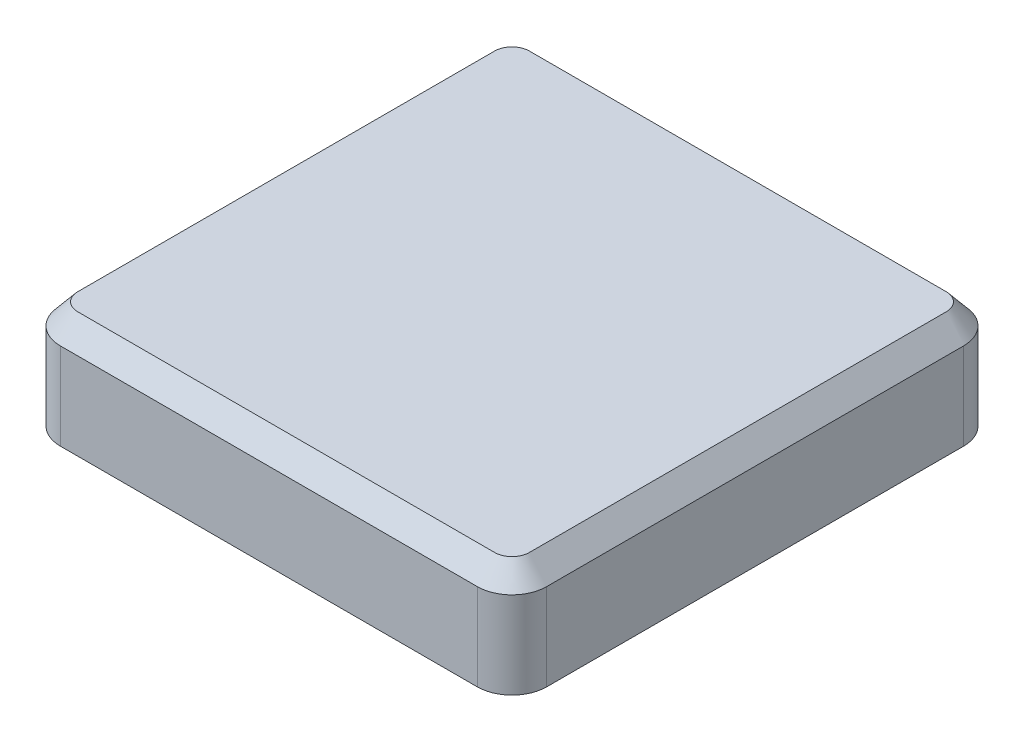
ISO-10303-21;
HEADER;
FILE_DESCRIPTION(('STEP AP214'),'2;1');
FILE_NAME('part.step','',(''),(''),'','','');
FILE_SCHEMA(('AUTOMOTIVE_DESIGN { 1 0 10303 214 1 1 1 1 }'));
ENDSEC;
DATA;
#1=APPLICATION_CONTEXT('core data for automotive mechanical design processes');
#2=APPLICATION_PROTOCOL_DEFINITION('international standard','automotive_design',2000,#1);
#3=PRODUCT_CONTEXT('',#1,'mechanical');
#4=PRODUCT('Part','Part','',(#3));
#5=PRODUCT_RELATED_PRODUCT_CATEGORY('part','',(#4));
#6=PRODUCT_DEFINITION_FORMATION('','',#4);
#7=PRODUCT_DEFINITION_CONTEXT('part definition',#1,'design');
#8=PRODUCT_DEFINITION('design','',#6,#7);
#9=PRODUCT_DEFINITION_SHAPE('','',#8);
#10=(LENGTH_UNIT() NAMED_UNIT(*) SI_UNIT(.MILLI.,.METRE.));
#11=(NAMED_UNIT(*) PLANE_ANGLE_UNIT() SI_UNIT($,.RADIAN.));
#12=(NAMED_UNIT(*) SI_UNIT($,.STERADIAN.) SOLID_ANGLE_UNIT());
#13=UNCERTAINTY_MEASURE_WITH_UNIT(LENGTH_MEASURE(1.E-05),#10,'distance_accuracy_value','');
#14=(GEOMETRIC_REPRESENTATION_CONTEXT(3) GLOBAL_UNCERTAINTY_ASSIGNED_CONTEXT((#13)) GLOBAL_UNIT_ASSIGNED_CONTEXT((#10,
#11,#12)) REPRESENTATION_CONTEXT('',''));
#15=CARTESIAN_POINT('',(0.,0.,0.));
#16=DIRECTION('',(0.,0.,1.));
#17=DIRECTION('',(1.,0.,0.));
#18=AXIS2_PLACEMENT_3D('',#15,#16,#17);
#19=CARTESIAN_POINT('',(-120.,50.,-120.));
#20=DIRECTION('',(0.,-1.,0.));
#21=DIRECTION('',(0.,0.,-1.));
#22=AXIS2_PLACEMENT_3D('',#19,#20,#21);
#23=CYLINDRICAL_SURFACE('',#22,20.);
#24=CARTESIAN_POINT('',(-120.,0.,-120.));
#25=DIRECTION('',(0.,1.,0.));
#26=DIRECTION('',(0.,0.,1.));
#27=AXIS2_PLACEMENT_3D('',#24,#25,#26);
#28=CIRCLE('',#27,20.);
#29=CARTESIAN_POINT('',(-120.,0.,-140.));
#30=VERTEX_POINT('',#29);
#31=CARTESIAN_POINT('',(-140.,0.,-120.));
#32=VERTEX_POINT('',#31);
#33=EDGE_CURVE('E340',#30,#32,#28,.T.);
#34=ORIENTED_EDGE('',*,*,#33,.T.);
#35=DIRECTION('',(0.,-1.,0.));
#36=VECTOR('',#35,1.);
#37=CARTESIAN_POINT('',(-140.,50.,-120.));
#38=LINE('',#37,#36);
#39=CARTESIAN_POINT('',(-140.,50.,-120.));
#40=VERTEX_POINT('',#39);
#41=EDGE_CURVE('E12',#40,#32,#38,.T.);
#42=ORIENTED_EDGE('',*,*,#41,.F.);
#43=CARTESIAN_POINT('',(-120.,50.,-140.));
#44=CARTESIAN_POINT('',(-120.18751473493,50.0000041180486,-139.999999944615));
#45=CARTESIAN_POINT('',(-120.37501929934,50.0000382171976,-139.997362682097));
#46=CARTESIAN_POINT('',(-120.749879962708,50.0001156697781,-139.986816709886));
#47=CARTESIAN_POINT('',(-120.937236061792,50.0001590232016,-139.978908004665));
#48=CARTESIAN_POINT('',(-121.498835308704,50.0002268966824,-139.947282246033));
#49=CARTESIAN_POINT('',(-121.872664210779,50.00018926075,-139.915665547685));
#50=CARTESIAN_POINT('',(-122.617925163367,50.0000131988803,-139.83146777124));
#51=CARTESIAN_POINT('',(-122.989357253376,49.9998747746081,-139.778887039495));
#52=CARTESIAN_POINT('',(-123.728407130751,49.9998420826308,-139.652973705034));
#53=CARTESIAN_POINT('',(-124.096027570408,49.9999476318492,-139.579656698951));
#54=CARTESIAN_POINT('',(-124.826560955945,50.0000905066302,-139.412488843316));
#55=CARTESIAN_POINT('',(-125.189473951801,50.0001278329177,-139.318638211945));
#56=CARTESIAN_POINT('',(-125.909463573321,50.0000728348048,-139.110694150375));
#57=CARTESIAN_POINT('',(-126.266540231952,49.999980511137,-138.996600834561));
#58=CARTESIAN_POINT('',(-126.885436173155,49.9998123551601,-138.77950602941));
#59=CARTESIAN_POINT('',(-127.148787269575,49.9997381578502,-138.680843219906));
#60=CARTESIAN_POINT('',(-127.671093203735,49.9996965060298,-138.472503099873));
#61=CARTESIAN_POINT('',(-127.930048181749,49.999729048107,-138.362826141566));
#62=CARTESIAN_POINT('',(-128.443110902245,49.9998982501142,-138.132648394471));
#63=CARTESIAN_POINT('',(-128.697218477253,50.0000349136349,-138.012147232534));
#64=CARTESIAN_POINT('',(-129.200123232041,50.000326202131,-137.760540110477));
#65=CARTESIAN_POINT('',(-129.448920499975,50.000480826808,-137.629434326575));
#66=CARTESIAN_POINT('',(-129.940723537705,50.000682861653,-137.356873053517));
#67=CARTESIAN_POINT('',(-130.183730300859,50.0007302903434,-137.215419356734));
#68=CARTESIAN_POINT('',(-130.663565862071,50.000485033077,-136.92239314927));
#69=CARTESIAN_POINT('',(-130.900394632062,50.0001923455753,-136.770820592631));
#70=CARTESIAN_POINT('',(-131.367450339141,49.9996180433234,-136.457827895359));
#71=CARTESIAN_POINT('',(-131.597677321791,49.9993364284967,-136.296407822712));
#72=CARTESIAN_POINT('',(-132.051122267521,49.9990420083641,-135.96400565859));
#73=CARTESIAN_POINT('',(-132.274340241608,49.9990292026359,-135.793023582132));
#74=CARTESIAN_POINT('',(-132.713365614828,49.9992837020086,-135.441805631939));
#75=CARTESIAN_POINT('',(-132.929173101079,49.9995510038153,-135.261569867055));
#76=CARTESIAN_POINT('',(-133.353004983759,50.0001943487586,-134.892154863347));
#77=CARTESIAN_POINT('',(-133.561029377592,50.0005703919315,-134.702975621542));
#78=CARTESIAN_POINT('',(-133.866934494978,50.0009549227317,-134.412768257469));
#79=CARTESIAN_POINT('',(-133.967883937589,50.0010531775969,-134.314956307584));
#80=CARTESIAN_POINT('',(-134.167698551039,50.001113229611,-134.117226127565));
#81=CARTESIAN_POINT('',(-134.266563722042,50.0010750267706,-134.017307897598));
#82=CARTESIAN_POINT('',(-134.559964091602,50.0008184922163,-133.714461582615));
#83=CARTESIAN_POINT('',(-134.751315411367,50.0004582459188,-133.508431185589));
#84=CARTESIAN_POINT('',(-135.125194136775,49.9997810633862,-133.088451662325));
#85=CARTESIAN_POINT('',(-135.307719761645,49.9994641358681,-132.874500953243));
#86=CARTESIAN_POINT('',(-135.663589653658,49.9990855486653,-132.439092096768));
#87=CARTESIAN_POINT('',(-135.836933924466,49.9990238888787,-132.217633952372));
#88=CARTESIAN_POINT('',(-136.174127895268,49.9991851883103,-131.767609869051));
#89=CARTESIAN_POINT('',(-136.337977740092,49.9994081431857,-131.53904403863));
#90=CARTESIAN_POINT('',(-136.655894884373,49.9999727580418,-131.075207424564));
#91=CARTESIAN_POINT('',(-136.809962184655,50.0003144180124,-130.839936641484));
#92=CARTESIAN_POINT('',(-137.108066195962,50.000679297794,-130.363066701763));
#93=CARTESIAN_POINT('',(-137.252101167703,50.0007024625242,-130.121466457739));
#94=CARTESIAN_POINT('',(-137.529854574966,50.0005815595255,-129.632407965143));
#95=CARTESIAN_POINT('',(-137.663572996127,50.000437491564,-129.384949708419));
#96=CARTESIAN_POINT('',(-137.920465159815,50.0001425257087,-128.884594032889));
#97=CARTESIAN_POINT('',(-138.043638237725,49.9999916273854,-128.631696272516));
#98=CARTESIAN_POINT('',(-138.279203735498,49.9997778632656,-128.120949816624));
#99=CARTESIAN_POINT('',(-138.391596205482,49.9997149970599,-127.863101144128));
#100=CARTESIAN_POINT('',(-138.712188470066,49.9997044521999,-127.083065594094));
#101=CARTESIAN_POINT('',(-138.903988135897,49.999934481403,-126.554028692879));
#102=CARTESIAN_POINT('',(-139.242284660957,50.0001364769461,-125.481829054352));
#103=CARTESIAN_POINT('',(-139.388792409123,50.0001085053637,-124.9386697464));
#104=CARTESIAN_POINT('',(-139.593208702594,49.9999380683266,-124.030203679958));
#105=CARTESIAN_POINT('',(-139.664269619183,49.9998381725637,-123.667806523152));
#106=CARTESIAN_POINT('',(-139.786216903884,49.9998814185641,-122.939697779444));
#107=CARTESIAN_POINT('',(-139.837107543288,50.0000245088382,-122.573986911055));
#108=CARTESIAN_POINT('',(-139.918514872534,50.0001968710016,-121.840816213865));
#109=CARTESIAN_POINT('',(-139.949060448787,50.0002263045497,-121.473359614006));
#110=CARTESIAN_POINT('',(-139.979618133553,50.0001555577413,-120.921329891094));
#111=CARTESIAN_POINT('',(-139.987260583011,50.0001128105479,-120.737150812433));
#112=CARTESIAN_POINT('',(-139.997451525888,50.0000370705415,-120.368650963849));
#113=CARTESIAN_POINT('',(-139.999999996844,50.0000040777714,-120.184330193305));
#114=CARTESIAN_POINT('',(-140.,50.,-120.));
#115=B_SPLINE_CURVE_WITH_KNOTS('',3,(#43,#44,#45,#46,#47,#48,#49,#50,#51,#52,#53,#54,#55,#56,
#57,#58,#59,#60,#61,#62,#63,#64,#65,#66,#67,#68,#69,#70,#71,#72,#73,#74,#75,#76,#77,#78,#79,#80,
#81,#82,#83,#84,#85,#86,#87,#88,#89,#90,#91,#92,#93,#94,#95,#96,#97,#98,#99,#100,#101,#102,#103,
#104,#105,#106,#107,#108,#109,#110,#111,#112,#113,#114),.UNSPECIFIED.,.F.,.F.,(4,2,2,2,2,2,2,2,
2,2,2,2,2,2,2,2,2,2,2,2,2,2,2,2,2,2,2,2,2,2,2,2,2,2,2,4),(0.,0.562505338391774,1.1250101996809,
2.24985574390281,3.37468270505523,4.49866587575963,5.62263710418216,6.7466019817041,
7.59004561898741,8.43346229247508,9.27690805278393,10.1203398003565,10.9636258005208,
11.8069156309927,12.6501996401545,13.4934823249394,14.3367550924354,15.1800281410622,
15.6016903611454,16.0233525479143,16.8666303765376,17.7100776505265,18.5535245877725,
19.3969586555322,20.2403926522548,21.0839725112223,21.9275535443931,22.7711877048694,
23.6148179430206,25.3008667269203,26.9865098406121,28.0938832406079,29.2010220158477,
30.3065854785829,30.859537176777,31.4124913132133),.UNSPECIFIED.);
#116=CARTESIAN_POINT('',(-120.,50.,-140.));
#117=VERTEX_POINT('',#116);
#118=EDGE_CURVE('E529',#117,#40,#115,.T.);
#119=ORIENTED_EDGE('',*,*,#118,.F.);
#120=DIRECTION('',(0.,-1.,0.));
#121=VECTOR('',#120,1.);
#122=CARTESIAN_POINT('',(-120.,50.,-140.));
#123=LINE('',#122,#121);
#124=EDGE_CURVE('E557',#117,#30,#123,.T.);
#125=ORIENTED_EDGE('',*,*,#124,.T.);
#126=EDGE_LOOP('',(#34,#42,#119,#125));
#127=FACE_BOUND('',#126,.T.);
#128=ADVANCED_FACE('F231',(#127),#23,.T.);
#129=CARTESIAN_POINT('',(-140.,50.,120.));
#130=DIRECTION('',(1.,0.,0.));
#131=DIRECTION('',(0.,0.,-1.));
#132=AXIS2_PLACEMENT_3D('',#129,#130,#131);
#133=PLANE('',#132);
#134=DIRECTION('',(0.,0.,1.));
#135=VECTOR('',#134,1.);
#136=CARTESIAN_POINT('',(-140.,0.,120.));
#137=LINE('',#136,#135);
#138=CARTESIAN_POINT('',(-140.,0.,120.));
#139=VERTEX_POINT('',#138);
#140=EDGE_CURVE('E509',#32,#139,#137,.T.);
#141=ORIENTED_EDGE('',*,*,#140,.T.);
#142=DIRECTION('',(0.,-1.,0.));
#143=VECTOR('',#142,1.);
#144=CARTESIAN_POINT('',(-140.,50.,120.));
#145=LINE('',#144,#143);
#146=CARTESIAN_POINT('',(-140.,50.,120.));
#147=VERTEX_POINT('',#146);
#148=EDGE_CURVE('E242',#147,#139,#145,.T.);
#149=ORIENTED_EDGE('',*,*,#148,.F.);
#150=DIRECTION('',(0.,0.,-1.));
#151=VECTOR('',#150,1.);
#152=CARTESIAN_POINT('',(-140.,50.,120.));
#153=LINE('',#152,#151);
#154=EDGE_CURVE('E235',#40,#147,#153,.F.);
#155=ORIENTED_EDGE('',*,*,#154,.F.);
#156=ORIENTED_EDGE('',*,*,#41,.T.);
#157=EDGE_LOOP('',(#141,#149,#155,#156));
#158=FACE_BOUND('',#157,.T.);
#159=ADVANCED_FACE('F621',(#158),#133,.F.);
#160=CARTESIAN_POINT('',(-120.,50.,120.));
#161=DIRECTION('',(0.,-1.,0.));
#162=DIRECTION('',(0.,0.,-1.));
#163=AXIS2_PLACEMENT_3D('',#160,#161,#162);
#164=CYLINDRICAL_SURFACE('',#163,20.);
#165=CARTESIAN_POINT('',(-120.,0.,120.));
#166=DIRECTION('',(0.,1.,0.));
#167=DIRECTION('',(0.,0.,1.));
#168=AXIS2_PLACEMENT_3D('',#165,#166,#167);
#169=CIRCLE('',#168,20.);
#170=CARTESIAN_POINT('',(-120.,0.,140.));
#171=VERTEX_POINT('',#170);
#172=EDGE_CURVE('E512',#139,#171,#169,.T.);
#173=ORIENTED_EDGE('',*,*,#172,.T.);
#174=DIRECTION('',(0.,-1.,0.));
#175=VECTOR('',#174,1.);
#176=CARTESIAN_POINT('',(-120.,50.,140.));
#177=LINE('',#176,#175);
#178=CARTESIAN_POINT('',(-120.,50.,140.));
#179=VERTEX_POINT('',#178);
#180=EDGE_CURVE('E574',#179,#171,#177,.T.);
#181=ORIENTED_EDGE('',*,*,#180,.F.);
#182=CARTESIAN_POINT('',(-140.,50.,120.));
#183=CARTESIAN_POINT('',(-139.999999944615,50.0000041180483,120.18751472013));
#184=CARTESIAN_POINT('',(-139.997362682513,50.0000382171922,120.375019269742));
#185=CARTESIAN_POINT('',(-139.986816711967,50.0001156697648,120.749879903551));
#186=CARTESIAN_POINT('',(-139.978908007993,50.0001590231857,120.937235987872));
#187=CARTESIAN_POINT('',(-139.947282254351,50.0002268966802,121.498835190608));
#188=CARTESIAN_POINT('',(-139.915665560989,50.0001892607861,121.872664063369));
#189=CARTESIAN_POINT('',(-139.831467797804,50.0000131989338,122.617924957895));
#190=CARTESIAN_POINT('',(-139.778887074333,49.9998747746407,122.989357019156));
#191=CARTESIAN_POINT('',(-139.65297375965,49.9998420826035,123.728406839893));
#192=CARTESIAN_POINT('',(-139.579656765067,49.999947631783,124.096027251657));
#193=CARTESIAN_POINT('',(-139.412488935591,50.0000905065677,124.82656058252));
#194=CARTESIAN_POINT('',(-139.318638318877,50.0001278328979,125.189473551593));
#195=CARTESIAN_POINT('',(-139.110694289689,50.0000728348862,125.90946312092));
#196=CARTESIAN_POINT('',(-138.996600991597,49.9999805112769,126.266539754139));
#197=CARTESIAN_POINT('',(-138.779506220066,49.9998123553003,126.885435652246));
#198=CARTESIAN_POINT('',(-138.680843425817,49.9997381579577,127.148786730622));
#199=CARTESIAN_POINT('',(-138.472503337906,49.9996965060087,127.671092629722));
#200=CARTESIAN_POINT('',(-138.362826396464,49.9997290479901,127.930047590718));
#201=CARTESIAN_POINT('',(-138.132648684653,49.9998982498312,128.443110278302));
#202=CARTESIAN_POINT('',(-138.012147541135,50.0000349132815,128.697217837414));
#203=CARTESIAN_POINT('',(-137.760540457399,50.0003262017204,129.20012256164));
#204=CARTESIAN_POINT('',(-137.629434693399,50.0004808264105,129.448919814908));
#205=CARTESIAN_POINT('',(-137.356873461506,50.000682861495,129.940722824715));
#206=CARTESIAN_POINT('',(-137.215419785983,50.0007302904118,130.18372957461));
#207=CARTESIAN_POINT('',(-136.922393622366,50.0004850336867,130.663565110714));
#208=CARTESIAN_POINT('',(-136.770821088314,50.0001923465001,130.900393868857));
#209=CARTESIAN_POINT('',(-136.457828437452,49.9996180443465,131.36744955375));
#210=CARTESIAN_POINT('',(-136.296408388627,49.9993364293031,131.597676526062));
#211=CARTESIAN_POINT('',(-135.964006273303,49.9990420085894,132.0511214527));
#212=CARTESIAN_POINT('',(-135.793024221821,49.9990292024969,132.274339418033));
#213=CARTESIAN_POINT('',(-135.44180630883,49.999283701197,132.713364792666));
#214=CARTESIAN_POINT('',(-135.261570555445,49.9995510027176,132.929172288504));
#215=CARTESIAN_POINT('',(-134.89215557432,50.0001943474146,133.353004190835));
#216=CARTESIAN_POINT('',(-134.702976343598,50.0005703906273,133.561028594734));
#217=CARTESIAN_POINT('',(-134.412768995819,50.0009549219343,133.866933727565));
#218=CARTESIAN_POINT('',(-134.314957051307,50.0010531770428,133.967883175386));
#219=CARTESIAN_POINT('',(-134.117226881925,50.0011132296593,134.167697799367));
#220=CARTESIAN_POINT('',(-134.017308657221,50.001075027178,134.266562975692));
#221=CARTESIAN_POINT('',(-133.714462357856,50.0008184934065,134.55996336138));
#222=CARTESIAN_POINT('',(-133.508431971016,50.0004582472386,134.751314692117));
#223=CARTESIAN_POINT('',(-133.088452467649,49.9997810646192,135.125193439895));
#224=CARTESIAN_POINT('',(-132.874501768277,49.9994641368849,135.307719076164));
#225=CARTESIAN_POINT('',(-132.439092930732,49.9990855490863,135.663588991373));
#226=CARTESIAN_POINT('',(-132.217634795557,49.9990238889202,135.836933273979));
#227=CARTESIAN_POINT('',(-131.767610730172,49.999185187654,136.174127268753));
#228=CARTESIAN_POINT('',(-131.539044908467,49.9994081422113,136.337977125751));
#229=CARTESIAN_POINT('',(-131.075208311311,49.9999727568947,136.655894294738));
#230=CARTESIAN_POINT('',(-130.839937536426,50.0003144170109,136.80996160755));
#231=CARTESIAN_POINT('',(-130.363067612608,50.0006792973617,137.108065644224));
#232=CARTESIAN_POINT('',(-130.121467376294,50.0007024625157,137.252100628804));
#233=CARTESIAN_POINT('',(-129.632408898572,50.0005815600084,137.52985406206));
#234=CARTESIAN_POINT('',(-129.38495064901,50.0004374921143,137.663572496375));
#235=CARTESIAN_POINT('',(-128.884594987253,50.0001425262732,137.92046468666));
#236=CARTESIAN_POINT('',(-128.63169723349,49.9999916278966,138.043637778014));
#237=CARTESIAN_POINT('',(-128.120950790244,49.9997778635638,138.279203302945));
#238=CARTESIAN_POINT('',(-127.863102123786,49.9997149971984,138.391595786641));
#239=CARTESIAN_POINT('',(-127.083066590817,49.9997044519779,138.712188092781));
#240=CARTESIAN_POINT('',(-126.55402969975,49.9999344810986,138.903987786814));
#241=CARTESIAN_POINT('',(-125.481830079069,50.0001364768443,139.242284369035));
#242=CARTESIAN_POINT('',(-124.938670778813,50.0001085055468,139.388792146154));
#243=CARTESIAN_POINT('',(-124.030204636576,49.9999380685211,139.593208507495));
#244=CARTESIAN_POINT('',(-123.667807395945,49.9998381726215,139.664269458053));
#245=CARTESIAN_POINT('',(-122.939698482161,49.9998814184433,139.786216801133));
#246=CARTESIAN_POINT('',(-122.573987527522,50.0000245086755,139.837107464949));
#247=CARTESIAN_POINT('',(-121.84081665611,50.0001968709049,139.918514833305));
#248=CARTESIAN_POINT('',(-121.47335996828,50.0002263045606,139.949060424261));
#249=CARTESIAN_POINT('',(-120.921330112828,50.0001555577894,139.979618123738));
#250=CARTESIAN_POINT('',(-120.737150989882,50.0001128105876,139.987260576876));
#251=CARTESIAN_POINT('',(-120.368651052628,50.0000370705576,139.99745152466));
#252=CARTESIAN_POINT('',(-120.184330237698,50.0000040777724,139.999999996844));
#253=CARTESIAN_POINT('',(-120.,50.,140.));
#254=B_SPLINE_CURVE_WITH_KNOTS('',3,(#182,#183,#184,#185,#186,#187,#188,#189,#190,#191,#192,
#193,#194,#195,#196,#197,#198,#199,#200,#201,#202,#203,#204,#205,#206,#207,#208,#209,#210,#211,
#212,#213,#214,#215,#216,#217,#218,#219,#220,#221,#222,#223,#224,#225,#226,#227,#228,#229,#230,
#231,#232,#233,#234,#235,#236,#237,#238,#239,#240,#241,#242,#243,#244,#245,#246,#247,#248,#249,
#250,#251,#252,#253),.UNSPECIFIED.,.F.,.F.,(4,2,2,2,2,2,2,2,2,2,2,2,2,2,2,2,2,2,2,2,2,2,2,2,2,2,
2,2,2,2,2,2,2,2,2,4),(0.,0.562505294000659,1.12501011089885,2.2498555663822,3.37468243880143,
4.49866552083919,5.6226366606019,6.74660144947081,7.5900450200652,8.43346162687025,
9.27690732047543,10.1203390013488,10.963624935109,11.8069146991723,12.6501986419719,
13.4934812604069,14.336754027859,15.1800270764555,15.6016892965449,16.0233514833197,
16.8666293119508,17.7100765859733,18.5535235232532,19.3969575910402,20.2403915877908,
21.0839714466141,21.9275524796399,22.7711866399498,23.6148168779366,25.3008656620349,
26.9865087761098,28.0938824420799,29.2010214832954,30.3065852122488,30.8595370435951,
31.4124913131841),.UNSPECIFIED.);
#255=EDGE_CURVE('E535',#147,#179,#254,.T.);
#256=ORIENTED_EDGE('',*,*,#255,.F.);
#257=ORIENTED_EDGE('',*,*,#148,.T.);
#258=EDGE_LOOP('',(#173,#181,#256,#257));
#259=FACE_BOUND('',#258,.T.);
#260=ADVANCED_FACE('F618',(#259),#164,.T.);
#261=CARTESIAN_POINT('',(-120.,50.,140.));
#262=DIRECTION('',(0.,0.,-1.));
#263=DIRECTION('',(-1.,0.,0.));
#264=AXIS2_PLACEMENT_3D('',#261,#262,#263);
#265=PLANE('',#264);
#266=DIRECTION('',(1.,0.,0.));
#267=VECTOR('',#266,1.);
#268=CARTESIAN_POINT('',(-120.,0.,140.));
#269=LINE('',#268,#267);
#270=CARTESIAN_POINT('',(120.,0.,140.));
#271=VERTEX_POINT('',#270);
#272=EDGE_CURVE('E515',#171,#271,#269,.T.);
#273=ORIENTED_EDGE('',*,*,#272,.T.);
#274=DIRECTION('',(0.,-1.,0.));
#275=VECTOR('',#274,1.);
#276=CARTESIAN_POINT('',(120.,50.,140.));
#277=LINE('',#276,#275);
#278=CARTESIAN_POINT('',(120.,50.,140.));
#279=VERTEX_POINT('',#278);
#280=EDGE_CURVE('E570',#279,#271,#277,.T.);
#281=ORIENTED_EDGE('',*,*,#280,.F.);
#282=DIRECTION('',(-1.,0.,0.));
#283=VECTOR('',#282,1.);
#284=CARTESIAN_POINT('',(-120.,50.,140.));
#285=LINE('',#284,#283);
#286=EDGE_CURVE('E538',#179,#279,#285,.F.);
#287=ORIENTED_EDGE('',*,*,#286,.F.);
#288=ORIENTED_EDGE('',*,*,#180,.T.);
#289=EDGE_LOOP('',(#273,#281,#287,#288));
#290=FACE_BOUND('',#289,.T.);
#291=ADVANCED_FACE('F607',(#290),#265,.F.);
#292=CARTESIAN_POINT('',(120.,50.,120.));
#293=DIRECTION('',(0.,-1.,0.));
#294=DIRECTION('',(0.,0.,-1.));
#295=AXIS2_PLACEMENT_3D('',#292,#293,#294);
#296=CYLINDRICAL_SURFACE('',#295,20.);
#297=CARTESIAN_POINT('',(120.,0.,120.));
#298=DIRECTION('',(0.,1.,0.));
#299=DIRECTION('',(0.,0.,1.));
#300=AXIS2_PLACEMENT_3D('',#297,#298,#299);
#301=CIRCLE('',#300,20.);
#302=CARTESIAN_POINT('',(140.,0.,120.));
#303=VERTEX_POINT('',#302);
#304=EDGE_CURVE('E518',#271,#303,#301,.T.);
#305=ORIENTED_EDGE('',*,*,#304,.T.);
#306=DIRECTION('',(0.,-1.,0.));
#307=VECTOR('',#306,1.);
#308=CARTESIAN_POINT('',(140.,50.,120.));
#309=LINE('',#308,#307);
#310=CARTESIAN_POINT('',(140.,50.,120.));
#311=VERTEX_POINT('',#310);
#312=EDGE_CURVE('E566',#311,#303,#309,.T.);
#313=ORIENTED_EDGE('',*,*,#312,.F.);
#314=CARTESIAN_POINT('',(120.,50.,140.));
#315=CARTESIAN_POINT('',(120.18751472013,50.0000041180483,139.999999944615));
#316=CARTESIAN_POINT('',(120.375019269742,50.0000382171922,139.997362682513));
#317=CARTESIAN_POINT('',(120.74987990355,50.0001156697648,139.986816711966));
#318=CARTESIAN_POINT('',(120.937235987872,50.0001590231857,139.978908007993));
#319=CARTESIAN_POINT('',(121.498835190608,50.0002268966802,139.947282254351));
#320=CARTESIAN_POINT('',(121.872664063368,50.0001892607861,139.915665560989));
#321=CARTESIAN_POINT('',(122.617924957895,50.0000131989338,139.831467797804));
#322=CARTESIAN_POINT('',(122.989357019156,49.9998747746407,139.778887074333));
#323=CARTESIAN_POINT('',(123.728406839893,49.9998420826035,139.65297375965));
#324=CARTESIAN_POINT('',(124.096027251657,49.999947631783,139.579656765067));
#325=CARTESIAN_POINT('',(124.826560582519,50.0000905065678,139.412488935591));
#326=CARTESIAN_POINT('',(125.189473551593,50.0001278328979,139.318638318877));
#327=CARTESIAN_POINT('',(125.909463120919,50.0000728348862,139.110694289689));
#328=CARTESIAN_POINT('',(126.266539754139,49.9999805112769,138.996600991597));
#329=CARTESIAN_POINT('',(126.885435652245,49.9998123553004,138.779506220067));
#330=CARTESIAN_POINT('',(127.148786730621,49.9997381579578,138.680843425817));
#331=CARTESIAN_POINT('',(127.671092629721,49.9996965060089,138.472503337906));
#332=CARTESIAN_POINT('',(127.930047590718,49.9997290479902,138.362826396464));
#333=CARTESIAN_POINT('',(128.443110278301,49.9998982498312,138.132648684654));
#334=CARTESIAN_POINT('',(128.697217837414,50.0000349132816,138.012147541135));
#335=CARTESIAN_POINT('',(129.200122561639,50.0003262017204,137.760540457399));
#336=CARTESIAN_POINT('',(129.448919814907,50.0004808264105,137.629434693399));
#337=CARTESIAN_POINT('',(129.940722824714,50.000682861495,137.356873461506));
#338=CARTESIAN_POINT('',(130.183729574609,50.0007302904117,137.215419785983));
#339=CARTESIAN_POINT('',(130.663565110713,50.0004850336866,136.922393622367));
#340=CARTESIAN_POINT('',(130.900393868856,50.0001923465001,136.770821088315));
#341=CARTESIAN_POINT('',(131.367449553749,49.9996180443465,136.457828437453));
#342=CARTESIAN_POINT('',(131.597676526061,49.9993364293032,136.296408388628));
#343=CARTESIAN_POINT('',(132.051121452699,49.9990420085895,135.964006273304));
#344=CARTESIAN_POINT('',(132.274339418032,49.999029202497,135.793024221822));
#345=CARTESIAN_POINT('',(132.713364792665,49.9992837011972,135.441806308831));
#346=CARTESIAN_POINT('',(132.929172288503,49.9995510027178,135.261570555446));
#347=CARTESIAN_POINT('',(133.353004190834,50.0001943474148,134.89215557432));
#348=CARTESIAN_POINT('',(133.561028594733,50.0005703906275,134.702976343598));
#349=CARTESIAN_POINT('',(133.866933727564,50.0009549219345,134.412768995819));
#350=CARTESIAN_POINT('',(133.967883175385,50.001053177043,134.314957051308));
#351=CARTESIAN_POINT('',(134.167697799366,50.0011132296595,134.117226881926));
#352=CARTESIAN_POINT('',(134.266562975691,50.0010750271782,134.017308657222));
#353=CARTESIAN_POINT('',(134.559963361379,50.0008184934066,133.714462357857));
#354=CARTESIAN_POINT('',(134.751314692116,50.0004582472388,133.508431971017));
#355=CARTESIAN_POINT('',(135.125193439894,49.9997810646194,133.08845246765));
#356=CARTESIAN_POINT('',(135.307719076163,49.9994641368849,132.874501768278));
#357=CARTESIAN_POINT('',(135.663588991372,49.9990855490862,132.439092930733));
#358=CARTESIAN_POINT('',(135.836933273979,49.99902388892,132.217634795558));
#359=CARTESIAN_POINT('',(136.174127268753,49.9991851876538,131.767610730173));
#360=CARTESIAN_POINT('',(136.337977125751,49.999408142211,131.539044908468));
#361=CARTESIAN_POINT('',(136.655894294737,49.9999727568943,131.075208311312));
#362=CARTESIAN_POINT('',(136.809961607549,50.0003144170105,130.839937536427));
#363=CARTESIAN_POINT('',(137.108065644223,50.0006792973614,130.363067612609));
#364=CARTESIAN_POINT('',(137.252100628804,50.0007024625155,130.121467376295));
#365=CARTESIAN_POINT('',(137.529854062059,50.0005815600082,129.632408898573));
#366=CARTESIAN_POINT('',(137.663572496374,50.0004374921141,129.384950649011));
#367=CARTESIAN_POINT('',(137.92046468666,50.0001425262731,128.884594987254));
#368=CARTESIAN_POINT('',(138.043637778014,49.9999916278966,128.631697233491));
#369=CARTESIAN_POINT('',(138.279203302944,49.999777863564,128.120950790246));
#370=CARTESIAN_POINT('',(138.39159578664,49.9997149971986,127.863102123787));
#371=CARTESIAN_POINT('',(138.712188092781,49.9997044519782,127.083066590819));
#372=CARTESIAN_POINT('',(138.903987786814,49.999934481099,126.554029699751));
#373=CARTESIAN_POINT('',(139.242284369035,50.0001364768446,125.48183007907));
#374=CARTESIAN_POINT('',(139.388792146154,50.0001085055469,124.938670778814));
#375=CARTESIAN_POINT('',(139.593208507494,49.9999380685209,124.030204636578));
#376=CARTESIAN_POINT('',(139.664269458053,49.9998381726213,123.667807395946));
#377=CARTESIAN_POINT('',(139.786216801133,49.999881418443,122.939698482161));
#378=CARTESIAN_POINT('',(139.837107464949,50.0000245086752,122.573987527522));
#379=CARTESIAN_POINT('',(139.918514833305,50.0001968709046,121.84081665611));
#380=CARTESIAN_POINT('',(139.949060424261,50.0002263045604,121.47335996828));
#381=CARTESIAN_POINT('',(139.979618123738,50.0001555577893,120.921330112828));
#382=CARTESIAN_POINT('',(139.987260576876,50.0001128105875,120.737150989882));
#383=CARTESIAN_POINT('',(139.99745152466,50.0000370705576,120.368651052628));
#384=CARTESIAN_POINT('',(139.999999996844,50.0000040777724,120.184330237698));
#385=CARTESIAN_POINT('',(140.,50.,120.));
#386=B_SPLINE_CURVE_WITH_KNOTS('',3,(#314,#315,#316,#317,#318,#319,#320,#321,#322,#323,#324,
#325,#326,#327,#328,#329,#330,#331,#332,#333,#334,#335,#336,#337,#338,#339,#340,#341,#342,#343,
#344,#345,#346,#347,#348,#349,#350,#351,#352,#353,#354,#355,#356,#357,#358,#359,#360,#361,#362,
#363,#364,#365,#366,#367,#368,#369,#370,#371,#372,#373,#374,#375,#376,#377,#378,#379,#380,#381,
#382,#383,#384,#385),.UNSPECIFIED.,.F.,.F.,(4,2,2,2,2,2,2,2,2,2,2,2,2,2,2,2,2,2,2,2,2,2,2,2,2,2,
2,2,2,2,2,2,2,2,2,4),(0.,0.562505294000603,1.12501011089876,2.24985556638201,3.37468243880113,
4.4986655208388,5.62263666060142,6.74660144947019,7.59004502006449,8.43346162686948,
9.27690732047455,10.1203390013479,10.9636249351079,11.8069146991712,12.6501986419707,
13.4934812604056,14.3367540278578,15.1800270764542,15.6016892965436,16.0233514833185,
16.8666293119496,17.710076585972,18.553523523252,19.396957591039,20.2403915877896,
21.0839714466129,21.9275524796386,22.7711866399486,23.6148168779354,25.3008656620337,
26.9865087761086,28.0938824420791,29.2010214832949,30.3065852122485,30.8595370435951,
31.4124913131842),.UNSPECIFIED.);
#387=EDGE_CURVE('E541',#279,#311,#386,.T.);
#388=ORIENTED_EDGE('',*,*,#387,.F.);
#389=ORIENTED_EDGE('',*,*,#280,.T.);
#390=EDGE_LOOP('',(#305,#313,#388,#389));
#391=FACE_BOUND('',#390,.T.);
#392=ADVANCED_FACE('F602',(#391),#296,.T.);
#393=CARTESIAN_POINT('',(140.,50.,120.));
#394=DIRECTION('',(-1.,0.,0.));
#395=DIRECTION('',(0.,0.,1.));
#396=AXIS2_PLACEMENT_3D('',#393,#394,#395);
#397=PLANE('',#396);
#398=DIRECTION('',(0.,0.,-1.));
#399=VECTOR('',#398,1.);
#400=CARTESIAN_POINT('',(140.,0.,120.));
#401=LINE('',#400,#399);
#402=CARTESIAN_POINT('',(140.,0.,-120.));
#403=VERTEX_POINT('',#402);
#404=EDGE_CURVE('E521',#303,#403,#401,.T.);
#405=ORIENTED_EDGE('',*,*,#404,.T.);
#406=DIRECTION('',(0.,-1.,0.));
#407=VECTOR('',#406,1.);
#408=CARTESIAN_POINT('',(140.,50.,-120.));
#409=LINE('',#408,#407);
#410=CARTESIAN_POINT('',(140.,50.,-120.));
#411=VERTEX_POINT('',#410);
#412=EDGE_CURVE('E562',#411,#403,#409,.T.);
#413=ORIENTED_EDGE('',*,*,#412,.F.);
#414=DIRECTION('',(0.,0.,1.));
#415=VECTOR('',#414,1.);
#416=CARTESIAN_POINT('',(140.,50.,120.));
#417=LINE('',#416,#415);
#418=EDGE_CURVE('E545',#311,#411,#417,.F.);
#419=ORIENTED_EDGE('',*,*,#418,.F.);
#420=ORIENTED_EDGE('',*,*,#312,.T.);
#421=EDGE_LOOP('',(#405,#413,#419,#420));
#422=FACE_BOUND('',#421,.T.);
#423=ADVANCED_FACE('F599',(#422),#397,.F.);
#424=CARTESIAN_POINT('',(120.,50.,-120.));
#425=DIRECTION('',(0.,-1.,0.));
#426=DIRECTION('',(0.,0.,-1.));
#427=AXIS2_PLACEMENT_3D('',#424,#425,#426);
#428=CYLINDRICAL_SURFACE('',#427,20.);
#429=CARTESIAN_POINT('',(120.,0.,-120.));
#430=DIRECTION('',(0.,1.,0.));
#431=DIRECTION('',(0.,0.,1.));
#432=AXIS2_PLACEMENT_3D('',#429,#430,#431);
#433=CIRCLE('',#432,20.);
#434=CARTESIAN_POINT('',(120.,0.,-140.));
#435=VERTEX_POINT('',#434);
#436=EDGE_CURVE('E524',#403,#435,#433,.T.);
#437=ORIENTED_EDGE('',*,*,#436,.T.);
#438=DIRECTION('',(0.,-1.,0.));
#439=VECTOR('',#438,1.);
#440=CARTESIAN_POINT('',(120.,50.,-140.));
#441=LINE('',#440,#439);
#442=CARTESIAN_POINT('',(120.,50.,-140.));
#443=VERTEX_POINT('',#442);
#444=EDGE_CURVE('E251',#443,#435,#441,.T.);
#445=ORIENTED_EDGE('',*,*,#444,.F.);
#446=CARTESIAN_POINT('',(140.,50.,-120.));
#447=CARTESIAN_POINT('',(139.999999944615,50.0000041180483,-120.187514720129));
#448=CARTESIAN_POINT('',(139.997362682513,50.0000382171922,-120.375019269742));
#449=CARTESIAN_POINT('',(139.986816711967,50.0001156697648,-120.74987990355));
#450=CARTESIAN_POINT('',(139.978908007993,50.0001590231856,-120.937235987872));
#451=CARTESIAN_POINT('',(139.947282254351,50.00022689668,-121.498835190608));
#452=CARTESIAN_POINT('',(139.915665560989,50.000189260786,-121.872664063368));
#453=CARTESIAN_POINT('',(139.831467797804,50.0000131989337,-122.617924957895));
#454=CARTESIAN_POINT('',(139.778887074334,49.9998747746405,-122.989357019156));
#455=CARTESIAN_POINT('',(139.65297375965,49.9998420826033,-123.728406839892));
#456=CARTESIAN_POINT('',(139.579656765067,49.9999476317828,-124.096027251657));
#457=CARTESIAN_POINT('',(139.412488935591,50.0000905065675,-124.826560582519));
#458=CARTESIAN_POINT('',(139.318638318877,50.0001278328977,-125.189473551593));
#459=CARTESIAN_POINT('',(139.110694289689,50.0000728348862,-125.909463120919));
#460=CARTESIAN_POINT('',(138.996600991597,49.999980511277,-126.266539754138));
#461=CARTESIAN_POINT('',(138.779506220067,49.9998123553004,-126.885435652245));
#462=CARTESIAN_POINT('',(138.680843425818,49.9997381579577,-127.148786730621));
#463=CARTESIAN_POINT('',(138.472503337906,49.9996965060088,-127.671092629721));
#464=CARTESIAN_POINT('',(138.362826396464,49.9997290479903,-127.930047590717));
#465=CARTESIAN_POINT('',(138.132648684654,49.9998982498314,-128.443110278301));
#466=CARTESIAN_POINT('',(138.012147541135,50.0000349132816,-128.697217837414));
#467=CARTESIAN_POINT('',(137.760540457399,50.0003262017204,-129.200122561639));
#468=CARTESIAN_POINT('',(137.629434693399,50.0004808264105,-129.448919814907));
#469=CARTESIAN_POINT('',(137.356873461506,50.0006828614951,-129.940722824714));
#470=CARTESIAN_POINT('',(137.215419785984,50.0007302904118,-130.183729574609));
#471=CARTESIAN_POINT('',(136.922393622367,50.0004850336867,-130.663565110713));
#472=CARTESIAN_POINT('',(136.770821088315,50.0001923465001,-130.900393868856));
#473=CARTESIAN_POINT('',(136.457828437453,49.9996180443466,-131.367449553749));
#474=CARTESIAN_POINT('',(136.296408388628,49.9993364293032,-131.597676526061));
#475=CARTESIAN_POINT('',(135.964006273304,49.9990420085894,-132.051121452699));
#476=CARTESIAN_POINT('',(135.793024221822,49.9990292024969,-132.274339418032));
#477=CARTESIAN_POINT('',(135.441806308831,49.9992837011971,-132.713364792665));
#478=CARTESIAN_POINT('',(135.261570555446,49.9995510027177,-132.929172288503));
#479=CARTESIAN_POINT('',(134.892155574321,50.0001943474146,-133.353004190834));
#480=CARTESIAN_POINT('',(134.702976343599,50.0005703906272,-133.561028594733));
#481=CARTESIAN_POINT('',(134.41276899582,50.0009549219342,-133.866933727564));
#482=CARTESIAN_POINT('',(134.314957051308,50.0010531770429,-133.967883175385));
#483=CARTESIAN_POINT('',(134.117226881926,50.0011132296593,-134.167697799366));
#484=CARTESIAN_POINT('',(134.017308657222,50.0010750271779,-134.266562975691));
#485=CARTESIAN_POINT('',(133.714462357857,50.0008184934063,-134.559963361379));
#486=CARTESIAN_POINT('',(133.508431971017,50.0004582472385,-134.751314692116));
#487=CARTESIAN_POINT('',(133.08845246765,49.9997810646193,-135.125193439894));
#488=CARTESIAN_POINT('',(132.874501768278,49.9994641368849,-135.307719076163));
#489=CARTESIAN_POINT('',(132.439092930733,49.9990855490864,-135.663588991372));
#490=CARTESIAN_POINT('',(132.217634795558,49.9990238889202,-135.836933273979));
#491=CARTESIAN_POINT('',(131.767610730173,49.9991851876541,-136.174127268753));
#492=CARTESIAN_POINT('',(131.539044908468,49.9994081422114,-136.337977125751));
#493=CARTESIAN_POINT('',(131.075208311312,49.9999727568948,-136.655894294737));
#494=CARTESIAN_POINT('',(130.839937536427,50.0003144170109,-136.809961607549));
#495=CARTESIAN_POINT('',(130.363067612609,50.0006792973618,-137.108065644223));
#496=CARTESIAN_POINT('',(130.121467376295,50.0007024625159,-137.252100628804));
#497=CARTESIAN_POINT('',(129.632408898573,50.0005815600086,-137.529854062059));
#498=CARTESIAN_POINT('',(129.384950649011,50.0004374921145,-137.663572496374));
#499=CARTESIAN_POINT('',(128.884594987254,50.0001425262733,-137.92046468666));
#500=CARTESIAN_POINT('',(128.631697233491,49.9999916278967,-138.043637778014));
#501=CARTESIAN_POINT('',(128.120950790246,49.999777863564,-138.279203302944));
#502=CARTESIAN_POINT('',(127.863102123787,49.9997149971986,-138.39159578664));
#503=CARTESIAN_POINT('',(127.083066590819,49.9997044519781,-138.712188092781));
#504=CARTESIAN_POINT('',(126.554029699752,49.9999344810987,-138.903987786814));
#505=CARTESIAN_POINT('',(125.48183007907,50.0001364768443,-139.242284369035));
#506=CARTESIAN_POINT('',(124.938670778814,50.0001085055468,-139.388792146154));
#507=CARTESIAN_POINT('',(124.030204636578,49.999938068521,-139.593208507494));
#508=CARTESIAN_POINT('',(123.667807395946,49.9998381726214,-139.664269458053));
#509=CARTESIAN_POINT('',(122.939698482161,49.9998814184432,-139.786216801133));
#510=CARTESIAN_POINT('',(122.573987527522,50.0000245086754,-139.837107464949));
#511=CARTESIAN_POINT('',(121.840816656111,50.0001968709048,-139.918514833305));
#512=CARTESIAN_POINT('',(121.47335996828,50.0002263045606,-139.949060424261));
#513=CARTESIAN_POINT('',(120.921330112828,50.0001555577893,-139.979618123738));
#514=CARTESIAN_POINT('',(120.737150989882,50.0001128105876,-139.987260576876));
#515=CARTESIAN_POINT('',(120.368651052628,50.0000370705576,-139.99745152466));
#516=CARTESIAN_POINT('',(120.184330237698,50.0000040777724,-139.999999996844));
#517=CARTESIAN_POINT('',(120.,50.,-140.));
#518=B_SPLINE_CURVE_WITH_KNOTS('',3,(#446,#447,#448,#449,#450,#451,#452,#453,#454,#455,#456,
#457,#458,#459,#460,#461,#462,#463,#464,#465,#466,#467,#468,#469,#470,#471,#472,#473,#474,#475,
#476,#477,#478,#479,#480,#481,#482,#483,#484,#485,#486,#487,#488,#489,#490,#491,#492,#493,#494,
#495,#496,#497,#498,#499,#500,#501,#502,#503,#504,#505,#506,#507,#508,#509,#510,#511,#512,#513,
#514,#515,#516,#517),.UNSPECIFIED.,.F.,.F.,(4,2,2,2,2,2,2,2,2,2,2,2,2,2,2,2,2,2,2,2,2,2,2,2,2,2,
2,2,2,2,2,2,2,2,2,4),(0.,0.562505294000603,1.12501011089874,2.249855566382,3.37468243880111,
4.49866552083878,5.62263666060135,6.74660144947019,7.59004502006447,8.43346162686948,
9.27690732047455,10.1203390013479,10.963624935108,11.8069146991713,12.6501986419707,
13.4934812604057,14.3367540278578,15.1800270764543,15.6016892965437,16.0233514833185,
16.8666293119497,17.7100765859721,18.5535235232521,19.3969575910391,20.2403915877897,
21.083971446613,21.9275524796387,22.7711866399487,23.6148168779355,25.3008656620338,
26.9865087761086,28.0938824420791,29.2010214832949,30.3065852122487,30.8595370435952,
31.4124913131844),.UNSPECIFIED.);
#519=EDGE_CURVE('E549',#411,#443,#518,.T.);
#520=ORIENTED_EDGE('',*,*,#519,.F.);
#521=ORIENTED_EDGE('',*,*,#412,.T.);
#522=EDGE_LOOP('',(#437,#445,#520,#521));
#523=FACE_BOUND('',#522,.T.);
#524=ADVANCED_FACE('F593',(#523),#428,.T.);
#525=CARTESIAN_POINT('',(-120.,50.,-140.));
#526=DIRECTION('',(0.,0.,1.));
#527=DIRECTION('',(1.,0.,0.));
#528=AXIS2_PLACEMENT_3D('',#525,#526,#527);
#529=PLANE('',#528);
#530=DIRECTION('',(-1.,0.,0.));
#531=VECTOR('',#530,1.);
#532=CARTESIAN_POINT('',(-120.,0.,-140.));
#533=LINE('',#532,#531);
#534=EDGE_CURVE('E279',#435,#30,#533,.T.);
#535=ORIENTED_EDGE('',*,*,#534,.T.);
#536=ORIENTED_EDGE('',*,*,#124,.F.);
#537=DIRECTION('',(1.,0.,0.));
#538=VECTOR('',#537,1.);
#539=CARTESIAN_POINT('',(-120.,50.,-140.));
#540=LINE('',#539,#538);
#541=EDGE_CURVE('E553',#443,#117,#540,.F.);
#542=ORIENTED_EDGE('',*,*,#541,.F.);
#543=ORIENTED_EDGE('',*,*,#444,.T.);
#544=EDGE_LOOP('',(#535,#536,#542,#543));
#545=FACE_BOUND('',#544,.T.);
#546=ADVANCED_FACE('F598',(#545),#529,.F.);
#547=CARTESIAN_POINT('',(-120.,0.,-120.));
#548=DIRECTION('',(0.,1.,0.));
#549=DIRECTION('',(0.,0.,1.));
#550=AXIS2_PLACEMENT_3D('',#547,#548,#549);
#551=PLANE('',#550);
#552=ORIENTED_EDGE('',*,*,#33,.F.);
#553=ORIENTED_EDGE('',*,*,#534,.F.);
#554=ORIENTED_EDGE('',*,*,#436,.F.);
#555=ORIENTED_EDGE('',*,*,#404,.F.);
#556=ORIENTED_EDGE('',*,*,#304,.F.);
#557=ORIENTED_EDGE('',*,*,#272,.F.);
#558=ORIENTED_EDGE('',*,*,#172,.F.);
#559=ORIENTED_EDGE('',*,*,#140,.F.);
#560=EDGE_LOOP('',(#552,#553,#554,#555,#556,#557,#558,#559));
#561=FACE_BOUND('',#560,.T.);
#562=ADVANCED_FACE('F366',(#561),#551,.F.);
#563=CARTESIAN_POINT('',(-120.,62.,-120.));
#564=DIRECTION('',(0.,1.,0.));
#565=DIRECTION('',(0.,0.,1.));
#566=AXIS2_PLACEMENT_3D('',#563,#564,#565);
#567=PLANE('',#566);
#568=CARTESIAN_POINT('',(-120.,62.,-120.));
#569=DIRECTION('',(0.,1.,0.));
#570=DIRECTION('',(0.,0.,1.));
#571=AXIS2_PLACEMENT_3D('',#568,#569,#570);
#572=CIRCLE('',#571,9.99999999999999);
#573=CARTESIAN_POINT('',(-120.,62.,-130.));
#574=VERTEX_POINT('',#573);
#575=CARTESIAN_POINT('',(-130.,62.,-120.000000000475));
#576=VERTEX_POINT('',#575);
#577=EDGE_CURVE('E335',#574,#576,#572,.T.);
#578=ORIENTED_EDGE('',*,*,#577,.T.);
#579=DIRECTION('',(0.,0.,1.));
#580=VECTOR('',#579,1.);
#581=CARTESIAN_POINT('',(-130.,62.,-120.));
#582=LINE('',#581,#580);
#583=CARTESIAN_POINT('',(-130.,62.,119.999999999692));
#584=VERTEX_POINT('',#583);
#585=EDGE_CURVE('E409',#576,#584,#582,.T.);
#586=ORIENTED_EDGE('',*,*,#585,.T.);
#587=CARTESIAN_POINT('',(-120.,62.,120.));
#588=DIRECTION('',(0.,1.,0.));
#589=DIRECTION('',(0.,0.,1.));
#590=AXIS2_PLACEMENT_3D('',#587,#588,#589);
#591=CIRCLE('',#590,10.);
#592=CARTESIAN_POINT('',(-120.000000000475,62.,130.));
#593=VERTEX_POINT('',#592);
#594=EDGE_CURVE('E417',#584,#593,#591,.T.);
#595=ORIENTED_EDGE('',*,*,#594,.T.);
#596=DIRECTION('',(1.,0.,0.));
#597=VECTOR('',#596,1.);
#598=CARTESIAN_POINT('',(-120.,62.,130.));
#599=LINE('',#598,#597);
#600=CARTESIAN_POINT('',(119.999999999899,62.,130.));
#601=VERTEX_POINT('',#600);
#602=EDGE_CURVE('E422',#593,#601,#599,.T.);
#603=ORIENTED_EDGE('',*,*,#602,.T.);
#604=CARTESIAN_POINT('',(120.,62.,120.));
#605=DIRECTION('',(0.,1.,0.));
#606=DIRECTION('',(0.,0.,1.));
#607=AXIS2_PLACEMENT_3D('',#604,#605,#606);
#608=CIRCLE('',#607,10.);
#609=CARTESIAN_POINT('',(130.,62.,120.000000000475));
#610=VERTEX_POINT('',#609);
#611=EDGE_CURVE('E473',#601,#610,#608,.T.);
#612=ORIENTED_EDGE('',*,*,#611,.T.);
#613=DIRECTION('',(0.,0.,-1.));
#614=VECTOR('',#613,1.);
#615=CARTESIAN_POINT('',(130.,62.,120.));
#616=LINE('',#615,#614);
#617=CARTESIAN_POINT('',(130.,62.,-119.999999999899));
#618=VERTEX_POINT('',#617);
#619=EDGE_CURVE('E346',#610,#618,#616,.T.);
#620=ORIENTED_EDGE('',*,*,#619,.T.);
#621=CARTESIAN_POINT('',(120.,62.,-120.));
#622=DIRECTION('',(0.,1.,0.));
#623=DIRECTION('',(0.,0.,1.));
#624=AXIS2_PLACEMENT_3D('',#621,#622,#623);
#625=CIRCLE('',#624,9.99999999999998);
#626=CARTESIAN_POINT('',(120.,62.,-130.));
#627=VERTEX_POINT('',#626);
#628=EDGE_CURVE('E331',#618,#627,#625,.T.);
#629=ORIENTED_EDGE('',*,*,#628,.T.);
#630=DIRECTION('',(-1.,0.,0.));
#631=VECTOR('',#630,1.);
#632=CARTESIAN_POINT('',(120.,62.,-130.));
#633=LINE('',#632,#631);
#634=EDGE_CURVE('E326',#627,#574,#633,.T.);
#635=ORIENTED_EDGE('',*,*,#634,.T.);
#636=EDGE_LOOP('',(#578,#586,#595,#603,#612,#620,#629,#635));
#637=FACE_BOUND('',#636,.T.);
#638=ADVANCED_FACE('F344',(#637),#567,.T.);
#639=CARTESIAN_POINT('',(-130.,62.,119.999999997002));
#640=CARTESIAN_POINT('',(-140.,50.,119.999999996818));
#641=CARTESIAN_POINT('',(-140.1,49.88,119.999999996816));
#642=CARTESIAN_POINT('',(-130.,62.,100.578741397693));
#643=CARTESIAN_POINT('',(-140.,50.,99.3857069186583));
#644=CARTESIAN_POINT('',(-140.1,49.88,99.3737765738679));
#645=CARTESIAN_POINT('',(-130.,62.,60.9064427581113));
#646=CARTESIAN_POINT('',(-140.,50.,59.1191455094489));
#647=CARTESIAN_POINT('',(-140.1,49.88,59.1012725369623));
#648=CARTESIAN_POINT('',(-130.,62.,0.));
#649=CARTESIAN_POINT('',(-140.,50.,0.));
#650=CARTESIAN_POINT('',(-140.1,49.88,0.));
#651=CARTESIAN_POINT('',(-130.,62.,-60.9064427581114));
#652=CARTESIAN_POINT('',(-140.,50.,-59.1191455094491));
#653=CARTESIAN_POINT('',(-140.1,49.88,-59.1012725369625));
#654=CARTESIAN_POINT('',(-130.,62.,-100.578741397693));
#655=CARTESIAN_POINT('',(-140.,50.,-99.3857069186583));
#656=CARTESIAN_POINT('',(-140.1,49.88,-99.373776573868));
#657=CARTESIAN_POINT('',(-130.,62.,-120.471934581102));
#658=CARTESIAN_POINT('',(-140.,50.,-120.500925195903));
#659=CARTESIAN_POINT('',(-140.1,49.88,-120.501215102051));
#660=CARTESIAN_POINT('',(-129.936310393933,62.,-121.309045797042));
#661=CARTESIAN_POINT('',(-139.962825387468,50.,-121.536897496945));
#662=CARTESIAN_POINT('',(-140.063090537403,49.88,-121.539176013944));
#663=CARTESIAN_POINT('',(-129.728337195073,62.0000000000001,-122.393196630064));
#664=CARTESIAN_POINT('',(-139.768494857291,50.,-123.191676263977));
#665=CARTESIAN_POINT('',(-139.868896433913,49.88,-123.199661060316));
#666=CARTESIAN_POINT('',(-129.436146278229,61.9999999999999,-123.357844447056));
#667=CARTESIAN_POINT('',(-139.40855094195,50.,-124.945729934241));
#668=CARTESIAN_POINT('',(-139.508274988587,49.88,-124.961608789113));
#669=CARTESIAN_POINT('',(-128.955421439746,62.0000000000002,-124.523774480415));
#670=CARTESIAN_POINT('',(-138.664257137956,50.,-127.391606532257));
#671=CARTESIAN_POINT('',(-138.761345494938,49.88,-127.420284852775));
#672=CARTESIAN_POINT('',(-128.207087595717,61.9999999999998,-125.799369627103));
#673=CARTESIAN_POINT('',(-137.156541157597,50.,-130.602533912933));
#674=CARTESIAN_POINT('',(-137.246035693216,49.88,-130.650565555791));
#675=CARTESIAN_POINT('',(-127.104990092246,62.0000000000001,-127.104990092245));
#676=CARTESIAN_POINT('',(-134.274403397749,50.,-134.274403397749));
#677=CARTESIAN_POINT('',(-134.346097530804,49.88,-134.346097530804));
#678=CARTESIAN_POINT('',(-125.799369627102,61.9999999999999,-128.207087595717));
#679=CARTESIAN_POINT('',(-130.602533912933,50.,-137.156541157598));
#680=CARTESIAN_POINT('',(-130.650565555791,49.88,-137.246035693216));
#681=CARTESIAN_POINT('',(-124.523774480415,62.,-128.955421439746));
#682=CARTESIAN_POINT('',(-127.391606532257,50.,-138.664257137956));
#683=CARTESIAN_POINT('',(-127.420284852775,49.88,-138.761345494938));
#684=CARTESIAN_POINT('',(-123.357844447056,62.0000000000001,-129.436146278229));
#685=CARTESIAN_POINT('',(-124.945729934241,50.,-139.40855094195));
#686=CARTESIAN_POINT('',(-124.961608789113,49.88,-139.508274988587));
#687=CARTESIAN_POINT('',(-122.393196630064,61.9999999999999,-129.728337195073));
#688=CARTESIAN_POINT('',(-123.191676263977,50.,-139.768494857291));
#689=CARTESIAN_POINT('',(-123.199661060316,49.88,-139.868896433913));
#690=CARTESIAN_POINT('',(-121.309045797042,62.0000000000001,-129.936310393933));
#691=CARTESIAN_POINT('',(-121.536897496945,50.,-139.962825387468));
#692=CARTESIAN_POINT('',(-121.539176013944,49.88,-140.063090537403));
#693=CARTESIAN_POINT('',(-120.471934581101,62.,-130.));
#694=CARTESIAN_POINT('',(-120.500925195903,50.,-140.));
#695=CARTESIAN_POINT('',(-120.501215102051,49.88,-140.1));
#696=CARTESIAN_POINT('',(-100.578741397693,62.,-130.));
#697=CARTESIAN_POINT('',(-99.3857069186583,50.,-140.));
#698=CARTESIAN_POINT('',(-99.3737765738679,49.88,-140.1));
#699=CARTESIAN_POINT('',(-60.9064427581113,62.,-130.));
#700=CARTESIAN_POINT('',(-59.119145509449,50.0000000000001,-140.));
#701=CARTESIAN_POINT('',(-59.1012725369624,49.8800000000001,-140.1));
#702=CARTESIAN_POINT('',(-1.17961196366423E-13,62.,-130.));
#703=CARTESIAN_POINT('',(0.,49.9999999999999,-140.));
#704=CARTESIAN_POINT('',(0.,49.8799999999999,-140.1));
#705=CARTESIAN_POINT('',(60.9064427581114,62.,-130.));
#706=CARTESIAN_POINT('',(59.119145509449,50.0000000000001,-140.));
#707=CARTESIAN_POINT('',(59.1012725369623,49.8800000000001,-140.1));
#708=CARTESIAN_POINT('',(100.578741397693,62.,-130.));
#709=CARTESIAN_POINT('',(99.3857069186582,50.,-140.));
#710=CARTESIAN_POINT('',(99.3737765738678,49.88,-140.1));
#711=CARTESIAN_POINT('',(120.471934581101,62.,-130.));
#712=CARTESIAN_POINT('',(120.500925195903,50.,-140.));
#713=CARTESIAN_POINT('',(120.501215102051,49.88,-140.1));
#714=CARTESIAN_POINT('',(121.309045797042,62.,-129.936310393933));
#715=CARTESIAN_POINT('',(121.536897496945,50.,-139.962825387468));
#716=CARTESIAN_POINT('',(121.539176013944,49.88,-140.063090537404));
#717=CARTESIAN_POINT('',(122.393196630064,62.,-129.728337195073));
#718=CARTESIAN_POINT('',(123.191676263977,50.,-139.768494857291));
#719=CARTESIAN_POINT('',(123.199661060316,49.88,-139.868896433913));
#720=CARTESIAN_POINT('',(123.357844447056,62.0000000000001,-129.436146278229));
#721=CARTESIAN_POINT('',(124.945729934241,50.,-139.40855094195));
#722=CARTESIAN_POINT('',(124.961608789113,49.88,-139.508274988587));
#723=CARTESIAN_POINT('',(124.523774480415,62.,-128.955421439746));
#724=CARTESIAN_POINT('',(127.391606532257,50.,-138.664257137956));
#725=CARTESIAN_POINT('',(127.420284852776,49.88,-138.761345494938));
#726=CARTESIAN_POINT('',(125.799369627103,62.,-128.207087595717));
#727=CARTESIAN_POINT('',(130.602533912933,50.0000000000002,-137.156541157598));
#728=CARTESIAN_POINT('',(130.650565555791,49.8800000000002,-137.246035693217));
#729=CARTESIAN_POINT('',(127.104990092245,61.9999999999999,-127.104990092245));
#730=CARTESIAN_POINT('',(134.274403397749,49.9999999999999,-134.274403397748));
#731=CARTESIAN_POINT('',(134.346097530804,49.8799999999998,-134.346097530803));
#732=CARTESIAN_POINT('',(128.207087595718,62.0000000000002,-125.799369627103));
#733=CARTESIAN_POINT('',(137.156541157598,50.0000000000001,-130.602533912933));
#734=CARTESIAN_POINT('',(137.246035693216,49.8800000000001,-130.650565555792));
#735=CARTESIAN_POINT('',(128.955421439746,61.9999999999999,-124.523774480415));
#736=CARTESIAN_POINT('',(138.664257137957,49.9999999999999,-127.391606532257));
#737=CARTESIAN_POINT('',(138.761345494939,49.8799999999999,-127.420284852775));
#738=CARTESIAN_POINT('',(129.436146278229,62.,-123.357844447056));
#739=CARTESIAN_POINT('',(139.40855094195,50.,-124.945729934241));
#740=CARTESIAN_POINT('',(139.508274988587,49.88,-124.961608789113));
#741=CARTESIAN_POINT('',(129.728337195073,62.,-122.393196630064));
#742=CARTESIAN_POINT('',(139.768494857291,50.,-123.191676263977));
#743=CARTESIAN_POINT('',(139.868896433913,49.8800000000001,-123.199661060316));
#744=CARTESIAN_POINT('',(129.936310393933,62.,-121.309045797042));
#745=CARTESIAN_POINT('',(139.962825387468,50.,-121.536897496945));
#746=CARTESIAN_POINT('',(140.063090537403,49.88,-121.539176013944));
#747=CARTESIAN_POINT('',(130.,62.,-120.471934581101));
#748=CARTESIAN_POINT('',(140.,50.,-120.500925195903));
#749=CARTESIAN_POINT('',(140.1,49.88,-120.501215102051));
#750=CARTESIAN_POINT('',(130.,62.,-100.578741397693));
#751=CARTESIAN_POINT('',(140.,50.,-99.3857069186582));
#752=CARTESIAN_POINT('',(140.1,49.88,-99.3737765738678));
#753=CARTESIAN_POINT('',(130.,61.9999999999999,-60.9064427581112));
#754=CARTESIAN_POINT('',(140.,49.9999999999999,-59.119145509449));
#755=CARTESIAN_POINT('',(140.1,49.8799999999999,-59.1012725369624));
#756=CARTESIAN_POINT('',(130.,62.,0.));
#757=CARTESIAN_POINT('',(140.,50.0000000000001,0.));
#758=CARTESIAN_POINT('',(140.1,49.8800000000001,0.));
#759=CARTESIAN_POINT('',(130.,62.,60.9064427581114));
#760=CARTESIAN_POINT('',(140.,50.,59.1191455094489));
#761=CARTESIAN_POINT('',(140.1,49.88,59.1012725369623));
#762=CARTESIAN_POINT('',(130.,62.,100.578741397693));
#763=CARTESIAN_POINT('',(140.,50.,99.3857069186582));
#764=CARTESIAN_POINT('',(140.1,49.88,99.3737765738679));
#765=CARTESIAN_POINT('',(130.,62.,120.471934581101));
#766=CARTESIAN_POINT('',(140.,50.,120.500925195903));
#767=CARTESIAN_POINT('',(140.1,49.88,120.501215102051));
#768=CARTESIAN_POINT('',(129.936310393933,62.,121.309045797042));
#769=CARTESIAN_POINT('',(139.962825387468,50.,121.536897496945));
#770=CARTESIAN_POINT('',(140.063090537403,49.88,121.539176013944));
#771=CARTESIAN_POINT('',(129.728337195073,62.,122.393196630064));
#772=CARTESIAN_POINT('',(139.768494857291,50.,123.191676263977));
#773=CARTESIAN_POINT('',(139.868896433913,49.88,123.199661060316));
#774=CARTESIAN_POINT('',(129.436146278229,62.,123.357844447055));
#775=CARTESIAN_POINT('',(139.40855094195,50.,124.945729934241));
#776=CARTESIAN_POINT('',(139.508274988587,49.88,124.961608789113));
#777=CARTESIAN_POINT('',(128.955421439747,62.0000000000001,124.523774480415));
#778=CARTESIAN_POINT('',(138.664257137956,50.0000000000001,127.391606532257));
#779=CARTESIAN_POINT('',(138.761345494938,49.8800000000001,127.420284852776));
#780=CARTESIAN_POINT('',(128.207087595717,61.9999999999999,125.799369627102));
#781=CARTESIAN_POINT('',(137.156541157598,50.,130.602533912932));
#782=CARTESIAN_POINT('',(137.246035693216,49.88,130.650565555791));
#783=CARTESIAN_POINT('',(127.104990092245,62.,127.104990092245));
#784=CARTESIAN_POINT('',(134.274403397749,50.,134.274403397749));
#785=CARTESIAN_POINT('',(134.346097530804,49.88,134.346097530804));
#786=CARTESIAN_POINT('',(125.799369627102,61.9999999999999,128.207087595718));
#787=CARTESIAN_POINT('',(130.602533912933,50.,137.156541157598));
#788=CARTESIAN_POINT('',(130.650565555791,49.88,137.246035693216));
#789=CARTESIAN_POINT('',(124.523774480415,62.0000000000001,128.955421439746));
#790=CARTESIAN_POINT('',(127.391606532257,50.,138.664257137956));
#791=CARTESIAN_POINT('',(127.420284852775,49.88,138.761345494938));
#792=CARTESIAN_POINT('',(123.357844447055,62.,129.436146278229));
#793=CARTESIAN_POINT('',(124.945729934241,50.,139.40855094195));
#794=CARTESIAN_POINT('',(124.961608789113,49.88,139.508274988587));
#795=CARTESIAN_POINT('',(122.393196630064,62.,129.728337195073));
#796=CARTESIAN_POINT('',(123.191676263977,50.,139.768494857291));
#797=CARTESIAN_POINT('',(123.199661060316,49.88,139.868896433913));
#798=CARTESIAN_POINT('',(121.309045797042,62.,129.936310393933));
#799=CARTESIAN_POINT('',(121.536897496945,50.,139.962825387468));
#800=CARTESIAN_POINT('',(121.539176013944,49.88,140.063090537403));
#801=CARTESIAN_POINT('',(120.471934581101,62.,130.));
#802=CARTESIAN_POINT('',(120.500925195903,50.,140.));
#803=CARTESIAN_POINT('',(120.501215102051,49.88,140.1));
#804=CARTESIAN_POINT('',(100.578741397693,62.,130.));
#805=CARTESIAN_POINT('',(99.3857069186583,50.,140.));
#806=CARTESIAN_POINT('',(99.373776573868,49.88,140.1));
#807=CARTESIAN_POINT('',(60.9064427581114,62.,130.));
#808=CARTESIAN_POINT('',(59.1191455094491,50.,140.));
#809=CARTESIAN_POINT('',(59.1012725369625,49.88,140.1));
#810=CARTESIAN_POINT('',(0.,62.,130.));
#811=CARTESIAN_POINT('',(0.,50.,140.));
#812=CARTESIAN_POINT('',(0.,49.88,140.1));
#813=CARTESIAN_POINT('',(-60.9064427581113,62.,130.));
#814=CARTESIAN_POINT('',(-59.119145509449,50.,140.));
#815=CARTESIAN_POINT('',(-59.1012725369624,49.88,140.1));
#816=CARTESIAN_POINT('',(-100.578741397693,62.,130.));
#817=CARTESIAN_POINT('',(-99.3857069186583,50.,140.));
#818=CARTESIAN_POINT('',(-99.3737765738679,49.88,140.1));
#819=CARTESIAN_POINT('',(-120.471934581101,62.,130.));
#820=CARTESIAN_POINT('',(-120.500925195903,50.,140.));
#821=CARTESIAN_POINT('',(-120.501215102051,49.88,140.1));
#822=CARTESIAN_POINT('',(-121.309045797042,62.,129.936310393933));
#823=CARTESIAN_POINT('',(-121.536897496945,50.,139.962825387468));
#824=CARTESIAN_POINT('',(-121.539176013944,49.88,140.063090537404));
#825=CARTESIAN_POINT('',(-122.393196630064,62.,129.728337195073));
#826=CARTESIAN_POINT('',(-123.191676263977,50.,139.768494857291));
#827=CARTESIAN_POINT('',(-123.199661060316,49.88,139.868896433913));
#828=CARTESIAN_POINT('',(-123.357844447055,62.,129.436146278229));
#829=CARTESIAN_POINT('',(-124.945729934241,50.,139.40855094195));
#830=CARTESIAN_POINT('',(-124.961608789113,49.88,139.508274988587));
#831=CARTESIAN_POINT('',(-124.523774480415,62.,128.955421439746));
#832=CARTESIAN_POINT('',(-127.391606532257,50.,138.664257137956));
#833=CARTESIAN_POINT('',(-127.420284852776,49.88,138.761345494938));
#834=CARTESIAN_POINT('',(-125.799369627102,62.,128.207087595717));
#835=CARTESIAN_POINT('',(-130.602533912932,50.,137.156541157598));
#836=CARTESIAN_POINT('',(-130.650565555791,49.88,137.246035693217));
#837=CARTESIAN_POINT('',(-127.104990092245,62.0000000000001,127.104990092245));
#838=CARTESIAN_POINT('',(-134.274403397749,50.,134.274403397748));
#839=CARTESIAN_POINT('',(-134.346097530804,49.88,134.346097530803));
#840=CARTESIAN_POINT('',(-128.207087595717,61.9999999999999,125.799369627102));
#841=CARTESIAN_POINT('',(-137.156541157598,50.,130.602533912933));
#842=CARTESIAN_POINT('',(-137.246035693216,49.88,130.650565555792));
#843=CARTESIAN_POINT('',(-128.955421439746,62.0000000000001,124.523774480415));
#844=CARTESIAN_POINT('',(-138.664257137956,50.,127.391606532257));
#845=CARTESIAN_POINT('',(-138.761345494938,49.88,127.420284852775));
#846=CARTESIAN_POINT('',(-129.436146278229,61.9999999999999,123.357844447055));
#847=CARTESIAN_POINT('',(-139.40855094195,50.,124.945729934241));
#848=CARTESIAN_POINT('',(-139.508274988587,49.88,124.961608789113));
#849=CARTESIAN_POINT('',(-129.728337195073,62.,122.393196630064));
#850=CARTESIAN_POINT('',(-139.768494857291,50.,123.191676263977));
#851=CARTESIAN_POINT('',(-139.868896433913,49.88,123.199661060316));
#852=CARTESIAN_POINT('',(-129.936310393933,62.,121.309045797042));
#853=CARTESIAN_POINT('',(-139.962825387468,50.,121.536897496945));
#854=CARTESIAN_POINT('',(-140.063090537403,49.88,121.539176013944));
#855=CARTESIAN_POINT('',(-130.,62.,120.471934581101));
#856=CARTESIAN_POINT('',(-140.,50.,120.500925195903));
#857=CARTESIAN_POINT('',(-140.1,49.88,120.501215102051));
#858=CARTESIAN_POINT('',(-130.,62.,119.999999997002));
#859=CARTESIAN_POINT('',(-140.,50.,119.999999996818));
#860=CARTESIAN_POINT('',(-140.1,49.88,119.999999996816));
#861=B_SPLINE_SURFACE_WITH_KNOTS('',3,1,((#639,#640,#641),(#642,#643,#644),(#645,#646,#647),
(#648,#649,#650),(#651,#652,#653),(#654,#655,#656),(#657,#658,#659),(#660,#661,#662),(#663,#664,
#665),(#666,#667,#668),(#669,#670,#671),(#672,#673,#674),(#675,#676,#677),(#678,#679,#680),
(#681,#682,#683),(#684,#685,#686),(#687,#688,#689),(#690,#691,#692),(#693,#694,#695),(#696,#697,
#698),(#699,#700,#701),(#702,#703,#704),(#705,#706,#707),(#708,#709,#710),(#711,#712,#713),
(#714,#715,#716),(#717,#718,#719),(#720,#721,#722),(#723,#724,#725),(#726,#727,#728),(#729,#730,
#731),(#732,#733,#734),(#735,#736,#737),(#738,#739,#740),(#741,#742,#743),(#744,#745,#746),
(#747,#748,#749),(#750,#751,#752),(#753,#754,#755),(#756,#757,#758),(#759,#760,#761),(#762,#763,
#764),(#765,#766,#767),(#768,#769,#770),(#771,#772,#773),(#774,#775,#776),(#777,#778,#779),
(#780,#781,#782),(#783,#784,#785),(#786,#787,#788),(#789,#790,#791),(#792,#793,#794),(#795,#796,
#797),(#798,#799,#800),(#801,#802,#803),(#804,#805,#806),(#807,#808,#809),(#810,#811,#812),
(#813,#814,#815),(#816,#817,#818),(#819,#820,#821),(#822,#823,#824),(#825,#826,#827),(#828,#829,
#830),(#831,#832,#833),(#834,#835,#836),(#837,#838,#839),(#840,#841,#842),(#843,#844,#845),
(#846,#847,#848),(#849,#850,#851),(#852,#853,#854),(#855,#856,#857),(#858,#859,#860)),
.UNSPECIFIED.,.T.,.F.,.F.,(4,1,1,1,2,1,1,1,1,1,1,1,1,1,1,1,2,1,1,1,2,1,1,1,1,1,1,1,1,1,1,1,2,1,
1,1,2,1,1,1,1,1,1,1,1,1,1,1,2,1,1,1,2,1,1,1,1,1,1,1,1,1,1,1,4),(2,1,2),(0.,0.0569632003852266,
0.113926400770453,0.17088960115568,0.227852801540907,0.2292370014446,0.230621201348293,
0.232005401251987,0.23338960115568,0.236158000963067,0.238926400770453,0.24169480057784,
0.244463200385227,0.24584740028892,0.247231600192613,0.248615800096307,0.25,0.306963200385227,
0.363926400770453,0.42088960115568,0.477852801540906,0.4792370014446,0.480621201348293,
0.482005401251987,0.48338960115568,0.486158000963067,0.488926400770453,0.49169480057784,
0.494463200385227,0.49584740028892,0.497231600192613,0.498615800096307,0.5,0.556963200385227,
0.613926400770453,0.67088960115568,0.727852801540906,0.7292370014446,0.730621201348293,
0.732005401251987,0.73338960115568,0.736158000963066,0.738926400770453,0.74169480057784,
0.744463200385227,0.74584740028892,0.747231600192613,0.748615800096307,0.75,0.806963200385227,
0.863926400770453,0.92088960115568,0.977852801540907,0.9792370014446,0.980621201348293,
0.982005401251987,0.98338960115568,0.986158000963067,0.988926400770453,0.99169480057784,
0.994463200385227,0.99584740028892,0.997231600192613,0.998615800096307,1.),(0.,1.,1.01),.UNSPECIFIED.);
#862=CARTESIAN_POINT('',(0.,62.,-130.));
#863=CARTESIAN_POINT('',(0.,50.,-140.));
#864=CARTESIAN_POINT('',(0.,49.88,-140.1));
#865=CARTESIAN_POINT('',(20.302147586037,62.,-130.));
#866=CARTESIAN_POINT('',(19.7063818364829,50.,-140.));
#867=CARTESIAN_POINT('',(19.7004241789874,49.88,-140.1));
#868=CARTESIAN_POINT('',(60.9064427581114,62.,-130.));
#869=CARTESIAN_POINT('',(59.119145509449,50.0000000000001,-140.));
#870=CARTESIAN_POINT('',(59.1012725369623,49.8800000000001,-140.1));
#871=CARTESIAN_POINT('',(100.578741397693,62.,-130.));
#872=CARTESIAN_POINT('',(99.3857069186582,50.,-140.));
#873=CARTESIAN_POINT('',(99.3737765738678,49.88,-140.1));
#874=CARTESIAN_POINT('',(120.471934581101,62.,-130.));
#875=CARTESIAN_POINT('',(120.500925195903,50.,-140.));
#876=CARTESIAN_POINT('',(120.501215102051,49.88,-140.1));
#877=CARTESIAN_POINT('',(121.309045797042,62.,-129.936310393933));
#878=CARTESIAN_POINT('',(121.536897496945,50.,-139.962825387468));
#879=CARTESIAN_POINT('',(121.539176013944,49.88,-140.063090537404));
#880=CARTESIAN_POINT('',(122.393196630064,62.,-129.728337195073));
#881=CARTESIAN_POINT('',(123.191676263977,50.,-139.768494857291));
#882=CARTESIAN_POINT('',(123.199661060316,49.88,-139.868896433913));
#883=CARTESIAN_POINT('',(123.357844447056,62.0000000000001,-129.436146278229));
#884=CARTESIAN_POINT('',(124.945729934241,50.,-139.40855094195));
#885=CARTESIAN_POINT('',(124.961608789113,49.88,-139.508274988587));
#886=CARTESIAN_POINT('',(124.523774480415,62.,-128.955421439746));
#887=CARTESIAN_POINT('',(127.391606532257,50.,-138.664257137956));
#888=CARTESIAN_POINT('',(127.420284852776,49.88,-138.761345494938));
#889=CARTESIAN_POINT('',(125.799369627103,62.,-128.207087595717));
#890=CARTESIAN_POINT('',(130.602533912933,50.0000000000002,-137.156541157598));
#891=CARTESIAN_POINT('',(130.650565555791,49.8800000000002,-137.246035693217));
#892=CARTESIAN_POINT('',(127.104990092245,61.9999999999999,-127.104990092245));
#893=CARTESIAN_POINT('',(134.274403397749,49.9999999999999,-134.274403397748));
#894=CARTESIAN_POINT('',(134.346097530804,49.8799999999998,-134.346097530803));
#895=CARTESIAN_POINT('',(128.207087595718,62.0000000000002,-125.799369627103));
#896=CARTESIAN_POINT('',(137.156541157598,50.0000000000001,-130.602533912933));
#897=CARTESIAN_POINT('',(137.246035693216,49.8800000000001,-130.650565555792));
#898=CARTESIAN_POINT('',(128.955421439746,61.9999999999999,-124.523774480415));
#899=CARTESIAN_POINT('',(138.664257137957,49.9999999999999,-127.391606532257));
#900=CARTESIAN_POINT('',(138.761345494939,49.8799999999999,-127.420284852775));
#901=CARTESIAN_POINT('',(129.436146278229,62.,-123.357844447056));
#902=CARTESIAN_POINT('',(139.40855094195,50.,-124.945729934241));
#903=CARTESIAN_POINT('',(139.508274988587,49.88,-124.961608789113));
#904=CARTESIAN_POINT('',(129.728337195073,62.,-122.393196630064));
#905=CARTESIAN_POINT('',(139.768494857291,50.,-123.191676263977));
#906=CARTESIAN_POINT('',(139.868896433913,49.8800000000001,-123.199661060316));
#907=CARTESIAN_POINT('',(129.936310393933,62.,-121.309045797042));
#908=CARTESIAN_POINT('',(139.962825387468,50.,-121.536897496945));
#909=CARTESIAN_POINT('',(140.063090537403,49.88,-121.539176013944));
#910=CARTESIAN_POINT('',(130.,62.,-120.471934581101));
#911=CARTESIAN_POINT('',(140.,50.,-120.500925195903));
#912=CARTESIAN_POINT('',(140.1,49.88,-120.501215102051));
#913=CARTESIAN_POINT('',(130.,62.,-100.578741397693));
#914=CARTESIAN_POINT('',(140.,50.,-99.3857069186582));
#915=CARTESIAN_POINT('',(140.1,49.88,-99.3737765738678));
#916=CARTESIAN_POINT('',(130.,61.9999999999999,-60.9064427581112));
#917=CARTESIAN_POINT('',(140.,49.9999999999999,-59.119145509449));
#918=CARTESIAN_POINT('',(140.1,49.8799999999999,-59.1012725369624));
#919=CARTESIAN_POINT('',(130.,62.,0.));
#920=CARTESIAN_POINT('',(140.,50.0000000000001,0.));
#921=CARTESIAN_POINT('',(140.1,49.8800000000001,0.));
#922=CARTESIAN_POINT('',(130.,62.,60.9064427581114));
#923=CARTESIAN_POINT('',(140.,50.,59.1191455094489));
#924=CARTESIAN_POINT('',(140.1,49.88,59.1012725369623));
#925=CARTESIAN_POINT('',(130.,62.,100.578741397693));
#926=CARTESIAN_POINT('',(140.,50.,99.3857069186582));
#927=CARTESIAN_POINT('',(140.1,49.88,99.3737765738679));
#928=CARTESIAN_POINT('',(130.,62.,120.471934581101));
#929=CARTESIAN_POINT('',(140.,50.,120.500925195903));
#930=CARTESIAN_POINT('',(140.1,49.88,120.501215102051));
#931=CARTESIAN_POINT('',(129.936310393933,62.,121.309045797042));
#932=CARTESIAN_POINT('',(139.962825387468,50.,121.536897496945));
#933=CARTESIAN_POINT('',(140.063090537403,49.88,121.539176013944));
#934=CARTESIAN_POINT('',(129.728337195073,62.,122.393196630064));
#935=CARTESIAN_POINT('',(139.768494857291,50.,123.191676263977));
#936=CARTESIAN_POINT('',(139.868896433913,49.88,123.199661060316));
#937=CARTESIAN_POINT('',(129.436146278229,62.,123.357844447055));
#938=CARTESIAN_POINT('',(139.40855094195,50.,124.945729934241));
#939=CARTESIAN_POINT('',(139.508274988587,49.88,124.961608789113));
#940=CARTESIAN_POINT('',(128.955421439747,62.0000000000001,124.523774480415));
#941=CARTESIAN_POINT('',(138.664257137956,50.0000000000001,127.391606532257));
#942=CARTESIAN_POINT('',(138.761345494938,49.8800000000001,127.420284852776));
#943=CARTESIAN_POINT('',(128.207087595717,61.9999999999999,125.799369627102));
#944=CARTESIAN_POINT('',(137.156541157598,50.,130.602533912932));
#945=CARTESIAN_POINT('',(137.246035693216,49.88,130.650565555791));
#946=CARTESIAN_POINT('',(127.104990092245,62.,127.104990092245));
#947=CARTESIAN_POINT('',(134.274403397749,50.,134.274403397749));
#948=CARTESIAN_POINT('',(134.346097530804,49.88,134.346097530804));
#949=CARTESIAN_POINT('',(125.799369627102,61.9999999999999,128.207087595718));
#950=CARTESIAN_POINT('',(130.602533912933,50.,137.156541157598));
#951=CARTESIAN_POINT('',(130.650565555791,49.88,137.246035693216));
#952=CARTESIAN_POINT('',(124.523774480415,62.0000000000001,128.955421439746));
#953=CARTESIAN_POINT('',(127.391606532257,50.,138.664257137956));
#954=CARTESIAN_POINT('',(127.420284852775,49.88,138.761345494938));
#955=CARTESIAN_POINT('',(123.357844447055,62.,129.436146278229));
#956=CARTESIAN_POINT('',(124.945729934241,50.,139.40855094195));
#957=CARTESIAN_POINT('',(124.961608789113,49.88,139.508274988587));
#958=CARTESIAN_POINT('',(122.393196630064,62.,129.728337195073));
#959=CARTESIAN_POINT('',(123.191676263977,50.,139.768494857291));
#960=CARTESIAN_POINT('',(123.199661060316,49.88,139.868896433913));
#961=CARTESIAN_POINT('',(121.309045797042,62.,129.936310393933));
#962=CARTESIAN_POINT('',(121.536897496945,50.,139.962825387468));
#963=CARTESIAN_POINT('',(121.539176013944,49.88,140.063090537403));
#964=CARTESIAN_POINT('',(120.471934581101,62.,130.));
#965=CARTESIAN_POINT('',(120.500925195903,50.,140.));
#966=CARTESIAN_POINT('',(120.501215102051,49.88,140.1));
#967=CARTESIAN_POINT('',(100.578741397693,62.,130.));
#968=CARTESIAN_POINT('',(99.3857069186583,50.,140.));
#969=CARTESIAN_POINT('',(99.373776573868,49.88,140.1));
#970=CARTESIAN_POINT('',(60.9064427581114,62.,130.));
#971=CARTESIAN_POINT('',(59.1191455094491,50.,140.));
#972=CARTESIAN_POINT('',(59.1012725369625,49.88,140.1));
#973=CARTESIAN_POINT('',(0.,62.,130.));
#974=CARTESIAN_POINT('',(0.,50.,140.));
#975=CARTESIAN_POINT('',(0.,49.88,140.1));
#976=CARTESIAN_POINT('',(-60.9064427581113,62.,130.));
#977=CARTESIAN_POINT('',(-59.119145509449,50.,140.));
#978=CARTESIAN_POINT('',(-59.1012725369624,49.88,140.1));
#979=CARTESIAN_POINT('',(-100.578741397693,62.,130.));
#980=CARTESIAN_POINT('',(-99.3857069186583,50.,140.));
#981=CARTESIAN_POINT('',(-99.3737765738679,49.88,140.1));
#982=CARTESIAN_POINT('',(-120.471934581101,62.,130.));
#983=CARTESIAN_POINT('',(-120.500925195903,50.,140.));
#984=CARTESIAN_POINT('',(-120.501215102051,49.88,140.1));
#985=CARTESIAN_POINT('',(-121.309045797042,62.,129.936310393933));
#986=CARTESIAN_POINT('',(-121.536897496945,50.,139.962825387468));
#987=CARTESIAN_POINT('',(-121.539176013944,49.88,140.063090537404));
#988=CARTESIAN_POINT('',(-122.393196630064,62.,129.728337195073));
#989=CARTESIAN_POINT('',(-123.191676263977,50.,139.768494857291));
#990=CARTESIAN_POINT('',(-123.199661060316,49.88,139.868896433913));
#991=CARTESIAN_POINT('',(-123.357844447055,62.,129.436146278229));
#992=CARTESIAN_POINT('',(-124.945729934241,50.,139.40855094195));
#993=CARTESIAN_POINT('',(-124.961608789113,49.88,139.508274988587));
#994=CARTESIAN_POINT('',(-124.523774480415,62.,128.955421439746));
#995=CARTESIAN_POINT('',(-127.391606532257,50.,138.664257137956));
#996=CARTESIAN_POINT('',(-127.420284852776,49.88,138.761345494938));
#997=CARTESIAN_POINT('',(-125.799369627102,62.,128.207087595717));
#998=CARTESIAN_POINT('',(-130.602533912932,50.,137.156541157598));
#999=CARTESIAN_POINT('',(-130.650565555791,49.88,137.246035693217));
#1000=CARTESIAN_POINT('',(-127.104990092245,62.0000000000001,127.104990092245));
#1001=CARTESIAN_POINT('',(-134.274403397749,50.,134.274403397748));
#1002=CARTESIAN_POINT('',(-134.346097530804,49.88,134.346097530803));
#1003=CARTESIAN_POINT('',(-128.207087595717,61.9999999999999,125.799369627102));
#1004=CARTESIAN_POINT('',(-137.156541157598,50.,130.602533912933));
#1005=CARTESIAN_POINT('',(-137.246035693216,49.88,130.650565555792));
#1006=CARTESIAN_POINT('',(-128.955421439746,62.0000000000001,124.523774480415));
#1007=CARTESIAN_POINT('',(-138.664257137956,50.,127.391606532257));
#1008=CARTESIAN_POINT('',(-138.761345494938,49.88,127.420284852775));
#1009=CARTESIAN_POINT('',(-129.436146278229,61.9999999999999,123.357844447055));
#1010=CARTESIAN_POINT('',(-139.40855094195,50.,124.945729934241));
#1011=CARTESIAN_POINT('',(-139.508274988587,49.88,124.961608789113));
#1012=CARTESIAN_POINT('',(-129.728337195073,62.,122.393196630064));
#1013=CARTESIAN_POINT('',(-139.768494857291,50.,123.191676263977));
#1014=CARTESIAN_POINT('',(-139.868896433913,49.88,123.199661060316));
#1015=CARTESIAN_POINT('',(-129.936310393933,62.,121.309045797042));
#1016=CARTESIAN_POINT('',(-139.962825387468,50.,121.536897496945));
#1017=CARTESIAN_POINT('',(-140.063090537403,49.88,121.539176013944));
#1018=CARTESIAN_POINT('',(-130.,62.,120.471934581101));
#1019=CARTESIAN_POINT('',(-140.,50.,120.500925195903));
#1020=CARTESIAN_POINT('',(-140.1,49.88,120.501215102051));
#1021=CARTESIAN_POINT('',(-130.,62.,100.578741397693));
#1022=CARTESIAN_POINT('',(-140.,50.,99.3857069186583));
#1023=CARTESIAN_POINT('',(-140.1,49.88,99.3737765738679));
#1024=CARTESIAN_POINT('',(-130.,62.,60.9064427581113));
#1025=CARTESIAN_POINT('',(-140.,50.,59.1191455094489));
#1026=CARTESIAN_POINT('',(-140.1,49.88,59.1012725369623));
#1027=CARTESIAN_POINT('',(-130.,62.,0.));
#1028=CARTESIAN_POINT('',(-140.,50.,0.));
#1029=CARTESIAN_POINT('',(-140.1,49.88,0.));
#1030=CARTESIAN_POINT('',(-130.,62.,-60.9064427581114));
#1031=CARTESIAN_POINT('',(-140.,50.,-59.1191455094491));
#1032=CARTESIAN_POINT('',(-140.1,49.88,-59.1012725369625));
#1033=CARTESIAN_POINT('',(-130.,62.,-100.578741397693));
#1034=CARTESIAN_POINT('',(-140.,50.,-99.3857069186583));
#1035=CARTESIAN_POINT('',(-140.1,49.88,-99.373776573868));
#1036=CARTESIAN_POINT('',(-130.,62.,-120.471934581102));
#1037=CARTESIAN_POINT('',(-140.,50.,-120.500925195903));
#1038=CARTESIAN_POINT('',(-140.1,49.88,-120.501215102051));
#1039=CARTESIAN_POINT('',(-129.936310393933,62.,-121.309045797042));
#1040=CARTESIAN_POINT('',(-139.962825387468,50.,-121.536897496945));
#1041=CARTESIAN_POINT('',(-140.063090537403,49.88,-121.539176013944));
#1042=CARTESIAN_POINT('',(-129.728337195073,62.0000000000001,-122.393196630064));
#1043=CARTESIAN_POINT('',(-139.768494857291,50.,-123.191676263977));
#1044=CARTESIAN_POINT('',(-139.868896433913,49.88,-123.199661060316));
#1045=CARTESIAN_POINT('',(-129.436146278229,61.9999999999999,-123.357844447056));
#1046=CARTESIAN_POINT('',(-139.40855094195,50.,-124.945729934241));
#1047=CARTESIAN_POINT('',(-139.508274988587,49.88,-124.961608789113));
#1048=CARTESIAN_POINT('',(-128.955421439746,62.0000000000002,-124.523774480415));
#1049=CARTESIAN_POINT('',(-138.664257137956,50.,-127.391606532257));
#1050=CARTESIAN_POINT('',(-138.761345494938,49.88,-127.420284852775));
#1051=CARTESIAN_POINT('',(-128.207087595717,61.9999999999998,-125.799369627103));
#1052=CARTESIAN_POINT('',(-137.156541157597,50.,-130.602533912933));
#1053=CARTESIAN_POINT('',(-137.246035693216,49.88,-130.650565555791));
#1054=CARTESIAN_POINT('',(-127.104990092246,62.0000000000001,-127.104990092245));
#1055=CARTESIAN_POINT('',(-134.274403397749,50.,-134.274403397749));
#1056=CARTESIAN_POINT('',(-134.346097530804,49.88,-134.346097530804));
#1057=CARTESIAN_POINT('',(-125.799369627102,61.9999999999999,-128.207087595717));
#1058=CARTESIAN_POINT('',(-130.602533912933,50.,-137.156541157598));
#1059=CARTESIAN_POINT('',(-130.650565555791,49.88,-137.246035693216));
#1060=CARTESIAN_POINT('',(-124.523774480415,62.,-128.955421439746));
#1061=CARTESIAN_POINT('',(-127.391606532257,50.,-138.664257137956));
#1062=CARTESIAN_POINT('',(-127.420284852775,49.88,-138.761345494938));
#1063=CARTESIAN_POINT('',(-123.357844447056,62.0000000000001,-129.436146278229));
#1064=CARTESIAN_POINT('',(-124.945729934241,50.,-139.40855094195));
#1065=CARTESIAN_POINT('',(-124.961608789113,49.88,-139.508274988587));
#1066=CARTESIAN_POINT('',(-122.393196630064,61.9999999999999,-129.728337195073));
#1067=CARTESIAN_POINT('',(-123.191676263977,50.,-139.768494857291));
#1068=CARTESIAN_POINT('',(-123.199661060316,49.88,-139.868896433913));
#1069=CARTESIAN_POINT('',(-121.309045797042,62.0000000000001,-129.936310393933));
#1070=CARTESIAN_POINT('',(-121.536897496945,50.,-139.962825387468));
#1071=CARTESIAN_POINT('',(-121.539176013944,49.88,-140.063090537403));
#1072=CARTESIAN_POINT('',(-120.471934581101,62.,-130.));
#1073=CARTESIAN_POINT('',(-120.500925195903,50.,-140.));
#1074=CARTESIAN_POINT('',(-120.501215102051,49.88,-140.1));
#1075=CARTESIAN_POINT('',(-100.578741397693,62.,-130.));
#1076=CARTESIAN_POINT('',(-99.3857069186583,50.,-140.));
#1077=CARTESIAN_POINT('',(-99.3737765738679,49.88,-140.1));
#1078=CARTESIAN_POINT('',(-60.9064427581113,62.,-130.));
#1079=CARTESIAN_POINT('',(-59.119145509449,50.0000000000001,-140.));
#1080=CARTESIAN_POINT('',(-59.1012725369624,49.8800000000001,-140.1));
#1081=CARTESIAN_POINT('',(-20.3021475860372,62.,-130.));
#1082=CARTESIAN_POINT('',(-19.706381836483,50.,-140.));
#1083=CARTESIAN_POINT('',(-19.7004241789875,49.88,-140.1));
#1084=CARTESIAN_POINT('',(0.,62.,-130.));
#1085=CARTESIAN_POINT('',(0.,50.,-140.));
#1086=CARTESIAN_POINT('',(0.,49.88,-140.1));
#1087=B_SPLINE_SURFACE_WITH_KNOTS('',3,1,((#862,#863,#864),(#865,#866,#867),(#868,#869,#870),
(#871,#872,#873),(#874,#875,#876),(#877,#878,#879),(#880,#881,#882),(#883,#884,#885),(#886,#887,
#888),(#889,#890,#891),(#892,#893,#894),(#895,#896,#897),(#898,#899,#900),(#901,#902,#903),
(#904,#905,#906),(#907,#908,#909),(#910,#911,#912),(#913,#914,#915),(#916,#917,#918),(#919,#920,
#921),(#922,#923,#924),(#925,#926,#927),(#928,#929,#930),(#931,#932,#933),(#934,#935,#936),
(#937,#938,#939),(#940,#941,#942),(#943,#944,#945),(#946,#947,#948),(#949,#950,#951),(#952,#953,
#954),(#955,#956,#957),(#958,#959,#960),(#961,#962,#963),(#964,#965,#966),(#967,#968,#969),
(#970,#971,#972),(#973,#974,#975),(#976,#977,#978),(#979,#980,#981),(#982,#983,#984),(#985,#986,
#987),(#988,#989,#990),(#991,#992,#993),(#994,#995,#996),(#997,#998,#999),(#1000,#1001,#1002),
(#1003,#1004,#1005),(#1006,#1007,#1008),(#1009,#1010,#1011),(#1012,#1013,#1014),(#1015,#1016,
#1017),(#1018,#1019,#1020),(#1021,#1022,#1023),(#1024,#1025,#1026),(#1027,#1028,#1029),(#1030,
#1031,#1032),(#1033,#1034,#1035),(#1036,#1037,#1038),(#1039,#1040,#1041),(#1042,#1043,#1044),
(#1045,#1046,#1047),(#1048,#1049,#1050),(#1051,#1052,#1053),(#1054,#1055,#1056),(#1057,#1058,
#1059),(#1060,#1061,#1062),(#1063,#1064,#1065),(#1066,#1067,#1068),(#1069,#1070,#1071),(#1072,
#1073,#1074),(#1075,#1076,#1077),(#1078,#1079,#1080),(#1081,#1082,#1083),(#1084,#1085,#1086)),
.UNSPECIFIED.,.T.,.F.,.F.,(4,1,2,1,1,1,1,1,1,1,1,1,1,1,2,1,1,1,2,1,1,1,1,1,1,1,1,1,1,1,2,1,1,1,
2,1,1,1,1,1,1,1,1,1,1,1,2,1,1,1,2,1,1,1,1,1,1,1,1,1,1,1,2,1,4),(2,1,2),(0.363926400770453,
0.42088960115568,0.477852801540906,0.4792370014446,0.480621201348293,0.482005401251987,
0.48338960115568,0.486158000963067,0.488926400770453,0.49169480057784,0.494463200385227,
0.49584740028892,0.497231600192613,0.498615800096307,0.5,0.556963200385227,0.613926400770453,
0.67088960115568,0.727852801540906,0.7292370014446,0.730621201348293,0.732005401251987,
0.73338960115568,0.736158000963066,0.738926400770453,0.74169480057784,0.744463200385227,
0.74584740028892,0.747231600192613,0.748615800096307,0.75,0.806963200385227,0.863926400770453,
0.92088960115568,0.977852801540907,0.9792370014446,0.980621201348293,0.982005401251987,
0.98338960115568,0.986158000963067,0.988926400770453,0.99169480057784,0.994463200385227,
0.99584740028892,0.997231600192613,0.998615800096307,1.,1.05696320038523,1.11392640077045,
1.17088960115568,1.22785280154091,1.2292370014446,1.23062120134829,1.23200540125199,
1.23338960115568,1.23615800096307,1.23892640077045,1.24169480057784,1.24446320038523,
1.24584740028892,1.24723160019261,1.24861580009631,1.25,1.30696320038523,1.36392640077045),(0.,
1.,1.01),.UNSPECIFIED.);
#1088=ORIENTED_EDGE('',*,*,#628,.F.);
#1089=ORIENTED_EDGE('',*,*,#619,.F.);
#1090=ORIENTED_EDGE('',*,*,#611,.F.);
#1091=ORIENTED_EDGE('',*,*,#602,.F.);
#1092=ORIENTED_EDGE('',*,*,#594,.F.);
#1093=ORIENTED_EDGE('',*,*,#585,.F.);
#1094=ORIENTED_EDGE('',*,*,#577,.F.);
#1095=ORIENTED_EDGE('',*,*,#634,.F.);
#1096=EDGE_LOOP('',(#1088,#1089,#1090,#1091,#1092,#1093,#1094,#1095));
#1097=FACE_BOUND('',#1096,.T.);
#1098=ORIENTED_EDGE('',*,*,#541,.T.);
#1099=ORIENTED_EDGE('',*,*,#118,.T.);
#1100=ORIENTED_EDGE('',*,*,#154,.T.);
#1101=ORIENTED_EDGE('',*,*,#255,.T.);
#1102=ORIENTED_EDGE('',*,*,#286,.T.);
#1103=ORIENTED_EDGE('',*,*,#387,.T.);
#1104=ORIENTED_EDGE('',*,*,#418,.T.);
#1105=ORIENTED_EDGE('',*,*,#519,.T.);
#1106=EDGE_LOOP('',(#1098,#1099,#1100,#1101,#1102,#1103,#1104,#1105));
#1107=FACE_BOUND('',#1106,.T.);
#1108=ADVANCED_FACE('F329',(#1097,#1107),#1087,.T.);
#1109=CLOSED_SHELL('',(#128,#159,#260,#291,#392,#423,#524,#546,#562,#638,#1108));
#1110=MANIFOLD_SOLID_BREP('B2',#1109);
#1111=ADVANCED_BREP_SHAPE_REPRESENTATION('',(#18,#1110),#14);
#1112=SHAPE_DEFINITION_REPRESENTATION(#9,#1111);
ENDSEC;
END-ISO-10303-21;
